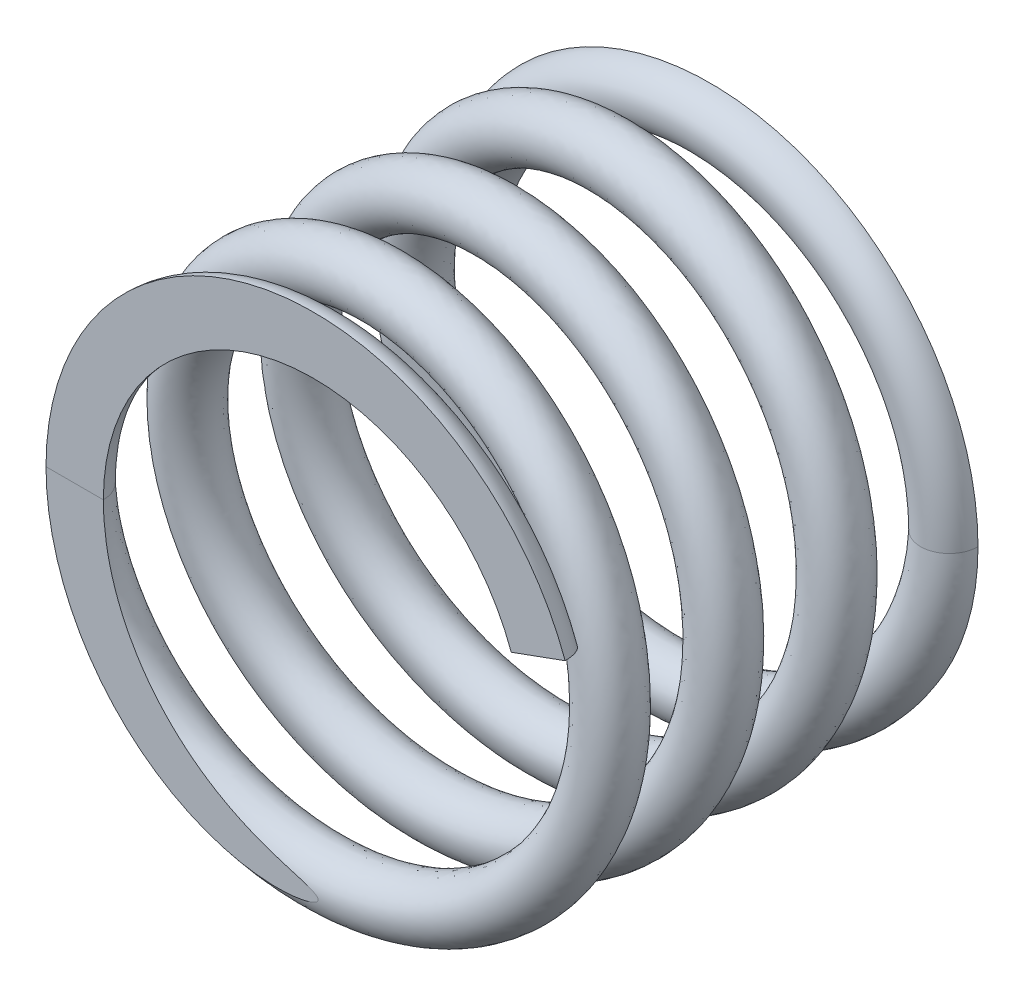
ISO-10303-21;
HEADER;
FILE_DESCRIPTION(('STEP AP214'),'2;1');
FILE_NAME('part.step','',(''),(''),'','','');
FILE_SCHEMA(('AUTOMOTIVE_DESIGN { 1 0 10303 214 1 1 1 1 }'));
ENDSEC;
DATA;
#1=APPLICATION_CONTEXT('core data for automotive mechanical design processes');
#2=APPLICATION_PROTOCOL_DEFINITION('international standard','automotive_design',2000,#1);
#3=PRODUCT_CONTEXT('',#1,'mechanical');
#4=PRODUCT('Part','Part','',(#3));
#5=PRODUCT_RELATED_PRODUCT_CATEGORY('part','',(#4));
#6=PRODUCT_DEFINITION_FORMATION('','',#4);
#7=PRODUCT_DEFINITION_CONTEXT('part definition',#1,'design');
#8=PRODUCT_DEFINITION('design','',#6,#7);
#9=PRODUCT_DEFINITION_SHAPE('','',#8);
#10=(LENGTH_UNIT() NAMED_UNIT(*) SI_UNIT(.MILLI.,.METRE.));
#11=(NAMED_UNIT(*) PLANE_ANGLE_UNIT() SI_UNIT($,.RADIAN.));
#12=(NAMED_UNIT(*) SI_UNIT($,.STERADIAN.) SOLID_ANGLE_UNIT());
#13=UNCERTAINTY_MEASURE_WITH_UNIT(LENGTH_MEASURE(1.E-05),#10,'distance_accuracy_value','');
#14=(GEOMETRIC_REPRESENTATION_CONTEXT(3) GLOBAL_UNCERTAINTY_ASSIGNED_CONTEXT((#13)) GLOBAL_UNIT_ASSIGNED_CONTEXT((#10,
#11,#12)) REPRESENTATION_CONTEXT('',''));
#15=CARTESIAN_POINT('',(0.,0.,0.));
#16=DIRECTION('',(0.,0.,1.));
#17=DIRECTION('',(1.,0.,0.));
#18=AXIS2_PLACEMENT_3D('',#15,#16,#17);
#19=CARTESIAN_POINT('',(5.,0.,0.6));
#20=CARTESIAN_POINT('',(5.,-1.62459848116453,0.718571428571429));
#21=CARTESIAN_POINT('',(4.04508497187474,-2.93892626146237,0.837142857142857));
#22=CARTESIAN_POINT('',(3.09016994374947,-4.2532540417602,0.955714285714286));
#23=CARTESIAN_POINT('',(1.54508497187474,-4.75528258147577,1.07428571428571));
#24=CARTESIAN_POINT('',(0.,-5.25731112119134,1.19285714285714));
#25=CARTESIAN_POINT('',(-1.54508497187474,-4.75528258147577,1.31142857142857));
#26=CARTESIAN_POINT('',(-3.09016994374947,-4.2532540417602,1.43));
#27=CARTESIAN_POINT('',(-4.04508497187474,-2.93892626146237,1.54857142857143));
#28=CARTESIAN_POINT('',(-5.,-1.62459848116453,1.66714285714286));
#29=CARTESIAN_POINT('',(-5.,0.,1.78571428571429));
#30=CARTESIAN_POINT('',(-5.,1.62459848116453,1.90428571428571));
#31=CARTESIAN_POINT('',(-4.04508497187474,2.93892626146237,2.02285714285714));
#32=CARTESIAN_POINT('',(-3.09016994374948,4.2532540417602,2.14142857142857));
#33=CARTESIAN_POINT('',(-1.54508497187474,4.75528258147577,2.26));
#34=CARTESIAN_POINT('',(0.,5.25731112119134,2.37857142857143));
#35=CARTESIAN_POINT('',(1.54508497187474,4.75528258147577,2.49714285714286));
#36=CARTESIAN_POINT('',(3.09016994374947,4.2532540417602,2.61571428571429));
#37=CARTESIAN_POINT('',(4.04508497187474,2.93892626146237,2.73428571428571));
#38=CARTESIAN_POINT('',(5.,1.62459848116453,2.85285714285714));
#39=CARTESIAN_POINT('',(5.,0.,2.97142857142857));
#40=CARTESIAN_POINT('',(5.,-1.62459848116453,3.09));
#41=CARTESIAN_POINT('',(4.04508497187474,-2.93892626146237,3.20857142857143));
#42=CARTESIAN_POINT('',(3.09016994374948,-4.2532540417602,3.32714285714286));
#43=CARTESIAN_POINT('',(1.54508497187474,-4.75528258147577,3.44571428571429));
#44=CARTESIAN_POINT('',(0.,-5.25731112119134,3.56428571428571));
#45=CARTESIAN_POINT('',(-1.54508497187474,-4.75528258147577,3.68285714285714));
#46=CARTESIAN_POINT('',(-3.09016994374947,-4.2532540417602,3.80142857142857));
#47=CARTESIAN_POINT('',(-4.04508497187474,-2.93892626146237,3.92));
#48=CARTESIAN_POINT('',(-5.,-1.62459848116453,4.03857142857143));
#49=CARTESIAN_POINT('',(-5.,0.,4.15714285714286));
#50=CARTESIAN_POINT('',(-5.,1.62459848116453,4.27571428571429));
#51=CARTESIAN_POINT('',(-4.04508497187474,2.93892626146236,4.39428571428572));
#52=CARTESIAN_POINT('',(-3.09016994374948,4.2532540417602,4.51285714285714));
#53=CARTESIAN_POINT('',(-1.54508497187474,4.75528258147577,4.63142857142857));
#54=CARTESIAN_POINT('',(0.,5.25731112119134,4.75));
#55=CARTESIAN_POINT('',(1.54508497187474,4.75528258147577,4.86857142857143));
#56=CARTESIAN_POINT('',(3.09016994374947,4.2532540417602,4.98714285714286));
#57=CARTESIAN_POINT('',(4.04508497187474,2.93892626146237,5.10571428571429));
#58=CARTESIAN_POINT('',(5.,1.62459848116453,5.22428571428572));
#59=CARTESIAN_POINT('',(5.,0.,5.34285714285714));
#60=CARTESIAN_POINT('',(5.,-1.62459848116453,5.46142857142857));
#61=CARTESIAN_POINT('',(4.04508497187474,-2.93892626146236,5.58));
#62=CARTESIAN_POINT('',(3.09016994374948,-4.2532540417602,5.69857142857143));
#63=CARTESIAN_POINT('',(1.54508497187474,-4.75528258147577,5.81714285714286));
#64=CARTESIAN_POINT('',(0.,-5.25731112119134,5.93571428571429));
#65=CARTESIAN_POINT('',(-1.54508497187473,-4.75528258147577,6.05428571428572));
#66=CARTESIAN_POINT('',(-3.09016994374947,-4.2532540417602,6.17285714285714));
#67=CARTESIAN_POINT('',(-4.04508497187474,-2.93892626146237,6.29142857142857));
#68=CARTESIAN_POINT('',(-5.,-1.62459848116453,6.41));
#69=CARTESIAN_POINT('',(-5.,0.,6.52857142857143));
#70=CARTESIAN_POINT('',(-5.,1.62459848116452,6.64714285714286));
#71=CARTESIAN_POINT('',(-4.04508497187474,2.93892626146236,6.76571428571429));
#72=CARTESIAN_POINT('',(-3.09016994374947,4.2532540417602,6.88428571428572));
#73=CARTESIAN_POINT('',(-1.54508497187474,4.75528258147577,7.00285714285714));
#74=CARTESIAN_POINT('',(0.,5.25731112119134,7.12142857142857));
#75=CARTESIAN_POINT('',(1.54508497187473,4.75528258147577,7.24));
#76=CARTESIAN_POINT('',(3.09016994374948,4.2532540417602,7.35857142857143));
#77=CARTESIAN_POINT('',(4.04508497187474,2.93892626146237,7.47714285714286));
#78=CARTESIAN_POINT('',(5.,1.62459848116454,7.59571428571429));
#79=CARTESIAN_POINT('',(5.,0.,7.71428571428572));
#80=CARTESIAN_POINT('',(5.,-1.62459848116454,7.83285714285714));
#81=CARTESIAN_POINT('',(4.04508497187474,-2.93892626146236,7.95142857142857));
#82=CARTESIAN_POINT('',(3.09016994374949,-4.25325404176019,8.07));
#83=CARTESIAN_POINT('',(1.54508497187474,-4.75528258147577,8.18857142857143));
#84=CARTESIAN_POINT('',(0.,-5.25731112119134,8.30714285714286));
#85=CARTESIAN_POINT('',(-1.54508497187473,-4.75528258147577,8.42571428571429));
#86=CARTESIAN_POINT('',(-3.09016994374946,-4.25325404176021,8.54428571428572));
#87=CARTESIAN_POINT('',(-4.04508497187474,-2.93892626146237,8.66285714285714));
#88=CARTESIAN_POINT('',(-5.,-1.62459848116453,8.78142857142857));
#89=CARTESIAN_POINT('',(-5.,0.,8.9));
#90=CARTESIAN_POINT('',(5.15694991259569,0.,0.6));
#91=CARTESIAN_POINT('',(5.15694991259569,-1.67559459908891,0.718571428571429));
#92=CARTESIAN_POINT('',(4.17206011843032,-3.03117910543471,0.837142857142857));
#93=CARTESIAN_POINT('',(3.18717032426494,-4.38676361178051,0.955714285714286));
#94=CARTESIAN_POINT('',(1.59358516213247,-4.90455081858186,1.07428571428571));
#95=CARTESIAN_POINT('',(0.,-5.42233802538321,1.19285714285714));
#96=CARTESIAN_POINT('',(-1.59358516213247,-4.90455081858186,1.31142857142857));
#97=CARTESIAN_POINT('',(-3.18717032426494,-4.38676361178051,1.43));
#98=CARTESIAN_POINT('',(-4.17206011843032,-3.03117910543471,1.54857142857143));
#99=CARTESIAN_POINT('',(-5.15694991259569,-1.67559459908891,1.66714285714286));
#100=CARTESIAN_POINT('',(-5.15694991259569,0.,1.78571428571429));
#101=CARTESIAN_POINT('',(-5.15694991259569,1.67559459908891,1.90428571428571));
#102=CARTESIAN_POINT('',(-4.17206011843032,3.03117910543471,2.02285714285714));
#103=CARTESIAN_POINT('',(-3.18717032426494,4.38676361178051,2.14142857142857));
#104=CARTESIAN_POINT('',(-1.59358516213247,4.90455081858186,2.26));
#105=CARTESIAN_POINT('',(0.,5.42233802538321,2.37857142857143));
#106=CARTESIAN_POINT('',(1.59358516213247,4.90455081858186,2.49714285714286));
#107=CARTESIAN_POINT('',(3.18717032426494,4.38676361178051,2.61571428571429));
#108=CARTESIAN_POINT('',(4.17206011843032,3.03117910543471,2.73428571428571));
#109=CARTESIAN_POINT('',(5.15694991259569,1.67559459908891,2.85285714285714));
#110=CARTESIAN_POINT('',(5.15694991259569,0.,2.97142857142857));
#111=CARTESIAN_POINT('',(5.15694991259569,-1.6755945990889,3.09));
#112=CARTESIAN_POINT('',(4.17206011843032,-3.03117910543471,3.20857142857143));
#113=CARTESIAN_POINT('',(3.18717032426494,-4.38676361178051,3.32714285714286));
#114=CARTESIAN_POINT('',(1.59358516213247,-4.90455081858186,3.44571428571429));
#115=CARTESIAN_POINT('',(0.,-5.42233802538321,3.56428571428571));
#116=CARTESIAN_POINT('',(-1.59358516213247,-4.90455081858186,3.68285714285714));
#117=CARTESIAN_POINT('',(-3.18717032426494,-4.38676361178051,3.80142857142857));
#118=CARTESIAN_POINT('',(-4.17206011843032,-3.03117910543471,3.92));
#119=CARTESIAN_POINT('',(-5.15694991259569,-1.67559459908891,4.03857142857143));
#120=CARTESIAN_POINT('',(-5.15694991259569,0.,4.15714285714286));
#121=CARTESIAN_POINT('',(-5.15694991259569,1.6755945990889,4.27571428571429));
#122=CARTESIAN_POINT('',(-4.17206011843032,3.03117910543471,4.39428571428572));
#123=CARTESIAN_POINT('',(-3.18717032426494,4.38676361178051,4.51285714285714));
#124=CARTESIAN_POINT('',(-1.59358516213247,4.90455081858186,4.63142857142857));
#125=CARTESIAN_POINT('',(0.,5.42233802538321,4.75));
#126=CARTESIAN_POINT('',(1.59358516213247,4.90455081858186,4.86857142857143));
#127=CARTESIAN_POINT('',(3.18717032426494,4.38676361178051,4.98714285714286));
#128=CARTESIAN_POINT('',(4.17206011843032,3.03117910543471,5.10571428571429));
#129=CARTESIAN_POINT('',(5.15694991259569,1.67559459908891,5.22428571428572));
#130=CARTESIAN_POINT('',(5.15694991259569,0.,5.34285714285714));
#131=CARTESIAN_POINT('',(5.15694991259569,-1.6755945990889,5.46142857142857));
#132=CARTESIAN_POINT('',(4.17206011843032,-3.03117910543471,5.58));
#133=CARTESIAN_POINT('',(3.18717032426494,-4.38676361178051,5.69857142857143));
#134=CARTESIAN_POINT('',(1.59358516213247,-4.90455081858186,5.81714285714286));
#135=CARTESIAN_POINT('',(0.,-5.42233802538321,5.93571428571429));
#136=CARTESIAN_POINT('',(-1.59358516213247,-4.90455081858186,6.05428571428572));
#137=CARTESIAN_POINT('',(-3.18717032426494,-4.38676361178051,6.17285714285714));
#138=CARTESIAN_POINT('',(-4.17206011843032,-3.03117910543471,6.29142857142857));
#139=CARTESIAN_POINT('',(-5.15694991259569,-1.67559459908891,6.41));
#140=CARTESIAN_POINT('',(-5.15694991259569,0.,6.52857142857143));
#141=CARTESIAN_POINT('',(-5.1569499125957,1.67559459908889,6.64714285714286));
#142=CARTESIAN_POINT('',(-4.17206011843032,3.0311791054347,6.76571428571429));
#143=CARTESIAN_POINT('',(-3.18717032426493,4.38676361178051,6.88428571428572));
#144=CARTESIAN_POINT('',(-1.59358516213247,4.90455081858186,7.00285714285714));
#145=CARTESIAN_POINT('',(0.,5.42233802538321,7.12142857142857));
#146=CARTESIAN_POINT('',(1.59358516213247,4.90455081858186,7.24));
#147=CARTESIAN_POINT('',(3.18717032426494,4.38676361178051,7.35857142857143));
#148=CARTESIAN_POINT('',(4.17206011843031,3.03117910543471,7.47714285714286));
#149=CARTESIAN_POINT('',(5.15694991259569,1.67559459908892,7.59571428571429));
#150=CARTESIAN_POINT('',(5.15694991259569,0.,7.71428571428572));
#151=CARTESIAN_POINT('',(5.15694991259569,-1.67559459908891,7.83285714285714));
#152=CARTESIAN_POINT('',(4.17206011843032,-3.0311791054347,7.95142857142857));
#153=CARTESIAN_POINT('',(3.18717032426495,-4.3867636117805,8.07));
#154=CARTESIAN_POINT('',(1.59358516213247,-4.90455081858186,8.18857142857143));
#155=CARTESIAN_POINT('',(0.,-5.42233802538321,8.30714285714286));
#156=CARTESIAN_POINT('',(-1.59358516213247,-4.90455081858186,8.42571428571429));
#157=CARTESIAN_POINT('',(-3.18717032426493,-4.38676361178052,8.54428571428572));
#158=CARTESIAN_POINT('',(-4.17206011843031,-3.03117910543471,8.66285714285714));
#159=CARTESIAN_POINT('',(-5.1569499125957,-1.6755945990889,8.78142857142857));
#160=CARTESIAN_POINT('',(-5.15694991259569,0.,8.9));
#161=CARTESIAN_POINT('',(5.6,0.,0.509716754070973));
#162=CARTESIAN_POINT('',(5.6,-1.81955029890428,0.628288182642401));
#163=CARTESIAN_POINT('',(4.53049516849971,-3.29159741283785,0.74685961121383));
#164=CARTESIAN_POINT('',(3.46099033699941,-4.76364452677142,0.865431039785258));
#165=CARTESIAN_POINT('',(1.73049516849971,-5.32591649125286,0.984002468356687));
#166=CARTESIAN_POINT('',(0.,-5.8881884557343,1.10257389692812));
#167=CARTESIAN_POINT('',(-1.7304951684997,-5.32591649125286,1.22114532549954));
#168=CARTESIAN_POINT('',(-3.46099033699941,-4.76364452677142,1.33971675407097));
#169=CARTESIAN_POINT('',(-4.53049516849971,-3.29159741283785,1.4582881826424));
#170=CARTESIAN_POINT('',(-5.6,-1.81955029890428,1.57685961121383));
#171=CARTESIAN_POINT('',(-5.6,0.,1.69543103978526));
#172=CARTESIAN_POINT('',(-5.6,1.81955029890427,1.81400246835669));
#173=CARTESIAN_POINT('',(-4.53049516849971,3.29159741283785,1.93257389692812));
#174=CARTESIAN_POINT('',(-3.46099033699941,4.76364452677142,2.05114532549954));
#175=CARTESIAN_POINT('',(-1.73049516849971,5.32591649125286,2.16971675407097));
#176=CARTESIAN_POINT('',(0.,5.8881884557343,2.2882881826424));
#177=CARTESIAN_POINT('',(1.7304951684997,5.32591649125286,2.40685961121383));
#178=CARTESIAN_POINT('',(3.46099033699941,4.76364452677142,2.52543103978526));
#179=CARTESIAN_POINT('',(4.53049516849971,3.29159741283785,2.64400246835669));
#180=CARTESIAN_POINT('',(5.6,1.81955029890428,2.76257389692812));
#181=CARTESIAN_POINT('',(5.6,0.,2.88114532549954));
#182=CARTESIAN_POINT('',(5.6,-1.81955029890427,2.99971675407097));
#183=CARTESIAN_POINT('',(4.53049516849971,-3.29159741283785,3.1182881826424));
#184=CARTESIAN_POINT('',(3.46099033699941,-4.76364452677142,3.23685961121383));
#185=CARTESIAN_POINT('',(1.73049516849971,-5.32591649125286,3.35543103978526));
#186=CARTESIAN_POINT('',(0.,-5.8881884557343,3.47400246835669));
#187=CARTESIAN_POINT('',(-1.7304951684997,-5.32591649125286,3.59257389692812));
#188=CARTESIAN_POINT('',(-3.46099033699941,-4.76364452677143,3.71114532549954));
#189=CARTESIAN_POINT('',(-4.53049516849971,-3.29159741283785,3.82971675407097));
#190=CARTESIAN_POINT('',(-5.6,-1.81955029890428,3.9482881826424));
#191=CARTESIAN_POINT('',(-5.6,0.,4.06685961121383));
#192=CARTESIAN_POINT('',(-5.6,1.81955029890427,4.18543103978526));
#193=CARTESIAN_POINT('',(-4.53049516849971,3.29159741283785,4.30400246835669));
#194=CARTESIAN_POINT('',(-3.46099033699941,4.76364452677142,4.42257389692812));
#195=CARTESIAN_POINT('',(-1.73049516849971,5.32591649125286,4.54114532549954));
#196=CARTESIAN_POINT('',(0.,5.8881884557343,4.65971675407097));
#197=CARTESIAN_POINT('',(1.7304951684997,5.32591649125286,4.7782881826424));
#198=CARTESIAN_POINT('',(3.46099033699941,4.76364452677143,4.89685961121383));
#199=CARTESIAN_POINT('',(4.5304951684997,3.29159741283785,5.01543103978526));
#200=CARTESIAN_POINT('',(5.6,1.81955029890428,5.13400246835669));
#201=CARTESIAN_POINT('',(5.6,0.,5.25257389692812));
#202=CARTESIAN_POINT('',(5.6,-1.81955029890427,5.37114532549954));
#203=CARTESIAN_POINT('',(4.53049516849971,-3.29159741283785,5.48971675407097));
#204=CARTESIAN_POINT('',(3.46099033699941,-4.76364452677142,5.6082881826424));
#205=CARTESIAN_POINT('',(1.73049516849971,-5.32591649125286,5.72685961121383));
#206=CARTESIAN_POINT('',(0.,-5.8881884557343,5.84543103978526));
#207=CARTESIAN_POINT('',(-1.7304951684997,-5.32591649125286,5.96400246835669));
#208=CARTESIAN_POINT('',(-3.46099033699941,-4.76364452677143,6.08257389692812));
#209=CARTESIAN_POINT('',(-4.5304951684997,-3.29159741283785,6.20114532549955));
#210=CARTESIAN_POINT('',(-5.6,-1.81955029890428,6.31971675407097));
#211=CARTESIAN_POINT('',(-5.6,0.,6.4382881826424));
#212=CARTESIAN_POINT('',(-5.6,1.81955029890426,6.55685961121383));
#213=CARTESIAN_POINT('',(-4.53049516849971,3.29159741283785,6.67543103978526));
#214=CARTESIAN_POINT('',(-3.46099033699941,4.76364452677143,6.79400246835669));
#215=CARTESIAN_POINT('',(-1.73049516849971,5.32591649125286,6.91257389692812));
#216=CARTESIAN_POINT('',(0.,5.8881884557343,7.03114532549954));
#217=CARTESIAN_POINT('',(1.7304951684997,5.32591649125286,7.14971675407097));
#218=CARTESIAN_POINT('',(3.46099033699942,4.76364452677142,7.2682881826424));
#219=CARTESIAN_POINT('',(4.5304951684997,3.29159741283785,7.38685961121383));
#220=CARTESIAN_POINT('',(5.6,1.81955029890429,7.50543103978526));
#221=CARTESIAN_POINT('',(5.6,0.,7.62400246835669));
#222=CARTESIAN_POINT('',(5.6,-1.81955029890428,7.74257389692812));
#223=CARTESIAN_POINT('',(4.53049516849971,-3.29159741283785,7.86114532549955));
#224=CARTESIAN_POINT('',(3.46099033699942,-4.76364452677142,7.97971675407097));
#225=CARTESIAN_POINT('',(1.73049516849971,-5.32591649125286,8.0982881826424));
#226=CARTESIAN_POINT('',(0.,-5.8881884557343,8.21685961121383));
#227=CARTESIAN_POINT('',(-1.7304951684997,-5.32591649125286,8.33543103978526));
#228=CARTESIAN_POINT('',(-3.4609903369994,-4.76364452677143,8.45400246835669));
#229=CARTESIAN_POINT('',(-4.5304951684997,-3.29159741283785,8.57257389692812));
#230=CARTESIAN_POINT('',(-5.6,-1.81955029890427,8.69114532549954));
#231=CARTESIAN_POINT('',(-5.6,0.,8.80971675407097));
#232=CARTESIAN_POINT('',(5.6,0.,-0.509716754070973));
#233=CARTESIAN_POINT('',(5.6,-1.81955029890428,-0.391145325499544));
#234=CARTESIAN_POINT('',(4.53049516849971,-3.29159741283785,-0.272573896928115));
#235=CARTESIAN_POINT('',(3.46099033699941,-4.76364452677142,-0.154002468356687));
#236=CARTESIAN_POINT('',(1.73049516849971,-5.32591649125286,-0.0354310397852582));
#237=CARTESIAN_POINT('',(0.,-5.8881884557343,0.0831403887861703));
#238=CARTESIAN_POINT('',(-1.7304951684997,-5.32591649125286,0.201711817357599));
#239=CARTESIAN_POINT('',(-3.46099033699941,-4.76364452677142,0.320283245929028));
#240=CARTESIAN_POINT('',(-4.53049516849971,-3.29159741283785,0.438854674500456));
#241=CARTESIAN_POINT('',(-5.6,-1.81955029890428,0.557426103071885));
#242=CARTESIAN_POINT('',(-5.6,0.,0.675997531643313));
#243=CARTESIAN_POINT('',(-5.6,1.81955029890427,0.794568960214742));
#244=CARTESIAN_POINT('',(-4.53049516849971,3.29159741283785,0.91314038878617));
#245=CARTESIAN_POINT('',(-3.46099033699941,4.76364452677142,1.0317118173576));
#246=CARTESIAN_POINT('',(-1.73049516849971,5.32591649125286,1.15028324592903));
#247=CARTESIAN_POINT('',(0.,5.8881884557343,1.26885467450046));
#248=CARTESIAN_POINT('',(1.7304951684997,5.32591649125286,1.38742610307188));
#249=CARTESIAN_POINT('',(3.46099033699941,4.76364452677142,1.50599753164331));
#250=CARTESIAN_POINT('',(4.53049516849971,3.29159741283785,1.62456896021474));
#251=CARTESIAN_POINT('',(5.6,1.81955029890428,1.74314038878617));
#252=CARTESIAN_POINT('',(5.6,0.,1.8617118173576));
#253=CARTESIAN_POINT('',(5.6,-1.81955029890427,1.98028324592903));
#254=CARTESIAN_POINT('',(4.53049516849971,-3.29159741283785,2.09885467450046));
#255=CARTESIAN_POINT('',(3.46099033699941,-4.76364452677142,2.21742610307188));
#256=CARTESIAN_POINT('',(1.73049516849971,-5.32591649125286,2.33599753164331));
#257=CARTESIAN_POINT('',(0.,-5.8881884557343,2.45456896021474));
#258=CARTESIAN_POINT('',(-1.7304951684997,-5.32591649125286,2.57314038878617));
#259=CARTESIAN_POINT('',(-3.46099033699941,-4.76364452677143,2.6917118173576));
#260=CARTESIAN_POINT('',(-4.53049516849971,-3.29159741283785,2.81028324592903));
#261=CARTESIAN_POINT('',(-5.6,-1.81955029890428,2.92885467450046));
#262=CARTESIAN_POINT('',(-5.6,0.,3.04742610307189));
#263=CARTESIAN_POINT('',(-5.6,1.81955029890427,3.16599753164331));
#264=CARTESIAN_POINT('',(-4.53049516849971,3.29159741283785,3.28456896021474));
#265=CARTESIAN_POINT('',(-3.46099033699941,4.76364452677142,3.40314038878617));
#266=CARTESIAN_POINT('',(-1.73049516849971,5.32591649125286,3.5217118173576));
#267=CARTESIAN_POINT('',(0.,5.8881884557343,3.64028324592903));
#268=CARTESIAN_POINT('',(1.7304951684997,5.32591649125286,3.75885467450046));
#269=CARTESIAN_POINT('',(3.46099033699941,4.76364452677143,3.87742610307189));
#270=CARTESIAN_POINT('',(4.5304951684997,3.29159741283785,3.99599753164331));
#271=CARTESIAN_POINT('',(5.6,1.81955029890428,4.11456896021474));
#272=CARTESIAN_POINT('',(5.6,0.,4.23314038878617));
#273=CARTESIAN_POINT('',(5.6,-1.81955029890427,4.3517118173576));
#274=CARTESIAN_POINT('',(4.53049516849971,-3.29159741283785,4.47028324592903));
#275=CARTESIAN_POINT('',(3.46099033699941,-4.76364452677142,4.58885467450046));
#276=CARTESIAN_POINT('',(1.73049516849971,-5.32591649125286,4.70742610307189));
#277=CARTESIAN_POINT('',(0.,-5.8881884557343,4.82599753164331));
#278=CARTESIAN_POINT('',(-1.7304951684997,-5.32591649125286,4.94456896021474));
#279=CARTESIAN_POINT('',(-3.46099033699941,-4.76364452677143,5.06314038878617));
#280=CARTESIAN_POINT('',(-4.5304951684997,-3.29159741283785,5.1817118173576));
#281=CARTESIAN_POINT('',(-5.6,-1.81955029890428,5.30028324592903));
#282=CARTESIAN_POINT('',(-5.6,0.,5.41885467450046));
#283=CARTESIAN_POINT('',(-5.6,1.81955029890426,5.53742610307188));
#284=CARTESIAN_POINT('',(-4.53049516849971,3.29159741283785,5.65599753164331));
#285=CARTESIAN_POINT('',(-3.46099033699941,4.76364452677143,5.77456896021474));
#286=CARTESIAN_POINT('',(-1.73049516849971,5.32591649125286,5.89314038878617));
#287=CARTESIAN_POINT('',(0.,5.8881884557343,6.0117118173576));
#288=CARTESIAN_POINT('',(1.7304951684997,5.32591649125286,6.13028324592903));
#289=CARTESIAN_POINT('',(3.46099033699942,4.76364452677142,6.24885467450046));
#290=CARTESIAN_POINT('',(4.5304951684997,3.29159741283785,6.36742610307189));
#291=CARTESIAN_POINT('',(5.6,1.81955029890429,6.48599753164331));
#292=CARTESIAN_POINT('',(5.6,0.,6.60456896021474));
#293=CARTESIAN_POINT('',(5.6,-1.81955029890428,6.72314038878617));
#294=CARTESIAN_POINT('',(4.53049516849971,-3.29159741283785,6.8417118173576));
#295=CARTESIAN_POINT('',(3.46099033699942,-4.76364452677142,6.96028324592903));
#296=CARTESIAN_POINT('',(1.73049516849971,-5.32591649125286,7.07885467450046));
#297=CARTESIAN_POINT('',(0.,-5.8881884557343,7.19742610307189));
#298=CARTESIAN_POINT('',(-1.7304951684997,-5.32591649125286,7.31599753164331));
#299=CARTESIAN_POINT('',(-3.4609903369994,-4.76364452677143,7.43456896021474));
#300=CARTESIAN_POINT('',(-4.5304951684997,-3.29159741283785,7.55314038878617));
#301=CARTESIAN_POINT('',(-5.6,-1.81955029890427,7.6717118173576));
#302=CARTESIAN_POINT('',(-5.6,0.,7.79028324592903));
#303=CARTESIAN_POINT('',(5.15694991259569,0.,-0.6));
#304=CARTESIAN_POINT('',(5.15694991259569,-1.67559459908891,-0.481428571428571));
#305=CARTESIAN_POINT('',(4.17206011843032,-3.03117910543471,-0.362857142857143));
#306=CARTESIAN_POINT('',(3.18717032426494,-4.38676361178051,-0.244285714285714));
#307=CARTESIAN_POINT('',(1.59358516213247,-4.90455081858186,-0.125714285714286));
#308=CARTESIAN_POINT('',(0.,-5.42233802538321,-0.00714285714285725));
#309=CARTESIAN_POINT('',(-1.59358516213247,-4.90455081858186,0.111428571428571));
#310=CARTESIAN_POINT('',(-3.18717032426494,-4.38676361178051,0.23));
#311=CARTESIAN_POINT('',(-4.17206011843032,-3.03117910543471,0.348571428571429));
#312=CARTESIAN_POINT('',(-5.15694991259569,-1.67559459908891,0.467142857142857));
#313=CARTESIAN_POINT('',(-5.15694991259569,0.,0.585714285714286));
#314=CARTESIAN_POINT('',(-5.15694991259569,1.67559459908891,0.704285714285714));
#315=CARTESIAN_POINT('',(-4.17206011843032,3.03117910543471,0.822857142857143));
#316=CARTESIAN_POINT('',(-3.18717032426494,4.38676361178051,0.941428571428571));
#317=CARTESIAN_POINT('',(-1.59358516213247,4.90455081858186,1.06));
#318=CARTESIAN_POINT('',(0.,5.42233802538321,1.17857142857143));
#319=CARTESIAN_POINT('',(1.59358516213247,4.90455081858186,1.29714285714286));
#320=CARTESIAN_POINT('',(3.18717032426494,4.38676361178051,1.41571428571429));
#321=CARTESIAN_POINT('',(4.17206011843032,3.03117910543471,1.53428571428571));
#322=CARTESIAN_POINT('',(5.15694991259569,1.67559459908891,1.65285714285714));
#323=CARTESIAN_POINT('',(5.15694991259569,0.,1.77142857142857));
#324=CARTESIAN_POINT('',(5.15694991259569,-1.6755945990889,1.89));
#325=CARTESIAN_POINT('',(4.17206011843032,-3.03117910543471,2.00857142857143));
#326=CARTESIAN_POINT('',(3.18717032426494,-4.38676361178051,2.12714285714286));
#327=CARTESIAN_POINT('',(1.59358516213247,-4.90455081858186,2.24571428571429));
#328=CARTESIAN_POINT('',(0.,-5.42233802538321,2.36428571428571));
#329=CARTESIAN_POINT('',(-1.59358516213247,-4.90455081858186,2.48285714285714));
#330=CARTESIAN_POINT('',(-3.18717032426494,-4.38676361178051,2.60142857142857));
#331=CARTESIAN_POINT('',(-4.17206011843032,-3.03117910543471,2.72));
#332=CARTESIAN_POINT('',(-5.15694991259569,-1.67559459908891,2.83857142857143));
#333=CARTESIAN_POINT('',(-5.15694991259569,0.,2.95714285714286));
#334=CARTESIAN_POINT('',(-5.15694991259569,1.6755945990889,3.07571428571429));
#335=CARTESIAN_POINT('',(-4.17206011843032,3.03117910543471,3.19428571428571));
#336=CARTESIAN_POINT('',(-3.18717032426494,4.38676361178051,3.31285714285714));
#337=CARTESIAN_POINT('',(-1.59358516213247,4.90455081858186,3.43142857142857));
#338=CARTESIAN_POINT('',(0.,5.42233802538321,3.55));
#339=CARTESIAN_POINT('',(1.59358516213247,4.90455081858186,3.66857142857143));
#340=CARTESIAN_POINT('',(3.18717032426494,4.38676361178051,3.78714285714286));
#341=CARTESIAN_POINT('',(4.17206011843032,3.03117910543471,3.90571428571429));
#342=CARTESIAN_POINT('',(5.15694991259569,1.67559459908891,4.02428571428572));
#343=CARTESIAN_POINT('',(5.15694991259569,0.,4.14285714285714));
#344=CARTESIAN_POINT('',(5.15694991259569,-1.6755945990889,4.26142857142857));
#345=CARTESIAN_POINT('',(4.17206011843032,-3.03117910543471,4.38));
#346=CARTESIAN_POINT('',(3.18717032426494,-4.38676361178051,4.49857142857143));
#347=CARTESIAN_POINT('',(1.59358516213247,-4.90455081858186,4.61714285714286));
#348=CARTESIAN_POINT('',(0.,-5.42233802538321,4.73571428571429));
#349=CARTESIAN_POINT('',(-1.59358516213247,-4.90455081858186,4.85428571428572));
#350=CARTESIAN_POINT('',(-3.18717032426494,-4.38676361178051,4.97285714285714));
#351=CARTESIAN_POINT('',(-4.17206011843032,-3.03117910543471,5.09142857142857));
#352=CARTESIAN_POINT('',(-5.15694991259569,-1.67559459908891,5.21));
#353=CARTESIAN_POINT('',(-5.15694991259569,0.,5.32857142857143));
#354=CARTESIAN_POINT('',(-5.1569499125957,1.67559459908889,5.44714285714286));
#355=CARTESIAN_POINT('',(-4.17206011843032,3.0311791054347,5.56571428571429));
#356=CARTESIAN_POINT('',(-3.18717032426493,4.38676361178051,5.68428571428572));
#357=CARTESIAN_POINT('',(-1.59358516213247,4.90455081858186,5.80285714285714));
#358=CARTESIAN_POINT('',(0.,5.42233802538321,5.92142857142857));
#359=CARTESIAN_POINT('',(1.59358516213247,4.90455081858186,6.04));
#360=CARTESIAN_POINT('',(3.18717032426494,4.38676361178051,6.15857142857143));
#361=CARTESIAN_POINT('',(4.17206011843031,3.03117910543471,6.27714285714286));
#362=CARTESIAN_POINT('',(5.15694991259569,1.67559459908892,6.39571428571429));
#363=CARTESIAN_POINT('',(5.15694991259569,0.,6.51428571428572));
#364=CARTESIAN_POINT('',(5.15694991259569,-1.67559459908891,6.63285714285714));
#365=CARTESIAN_POINT('',(4.17206011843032,-3.0311791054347,6.75142857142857));
#366=CARTESIAN_POINT('',(3.18717032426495,-4.3867636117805,6.87));
#367=CARTESIAN_POINT('',(1.59358516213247,-4.90455081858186,6.98857142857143));
#368=CARTESIAN_POINT('',(0.,-5.42233802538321,7.10714285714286));
#369=CARTESIAN_POINT('',(-1.59358516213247,-4.90455081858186,7.22571428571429));
#370=CARTESIAN_POINT('',(-3.18717032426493,-4.38676361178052,7.34428571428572));
#371=CARTESIAN_POINT('',(-4.17206011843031,-3.03117910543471,7.46285714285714));
#372=CARTESIAN_POINT('',(-5.1569499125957,-1.6755945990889,7.58142857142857));
#373=CARTESIAN_POINT('',(-5.15694991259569,0.,7.7));
#374=CARTESIAN_POINT('',(4.84305008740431,0.,-0.6));
#375=CARTESIAN_POINT('',(4.84305008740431,-1.57360236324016,-0.481428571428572));
#376=CARTESIAN_POINT('',(3.91810982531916,-2.84667341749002,-0.362857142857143));
#377=CARTESIAN_POINT('',(2.99316956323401,-4.11974447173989,-0.244285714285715));
#378=CARTESIAN_POINT('',(1.49658478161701,-4.60601434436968,-0.125714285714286));
#379=CARTESIAN_POINT('',(0.,-5.09228421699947,-0.00714285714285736));
#380=CARTESIAN_POINT('',(-1.496584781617,-4.60601434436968,0.111428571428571));
#381=CARTESIAN_POINT('',(-2.99316956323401,-4.11974447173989,0.23));
#382=CARTESIAN_POINT('',(-3.91810982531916,-2.84667341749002,0.348571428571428));
#383=CARTESIAN_POINT('',(-4.84305008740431,-1.57360236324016,0.467142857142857));
#384=CARTESIAN_POINT('',(-4.84305008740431,0.,0.585714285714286));
#385=CARTESIAN_POINT('',(-4.84305008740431,1.57360236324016,0.704285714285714));
#386=CARTESIAN_POINT('',(-3.91810982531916,2.84667341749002,0.822857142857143));
#387=CARTESIAN_POINT('',(-2.99316956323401,4.11974447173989,0.941428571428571));
#388=CARTESIAN_POINT('',(-1.49658478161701,4.60601434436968,1.06));
#389=CARTESIAN_POINT('',(0.,5.09228421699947,1.17857142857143));
#390=CARTESIAN_POINT('',(1.496584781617,4.60601434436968,1.29714285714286));
#391=CARTESIAN_POINT('',(2.99316956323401,4.11974447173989,1.41571428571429));
#392=CARTESIAN_POINT('',(3.91810982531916,2.84667341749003,1.53428571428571));
#393=CARTESIAN_POINT('',(4.84305008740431,1.57360236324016,1.65285714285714));
#394=CARTESIAN_POINT('',(4.84305008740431,0.,1.77142857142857));
#395=CARTESIAN_POINT('',(4.84305008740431,-1.57360236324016,1.89));
#396=CARTESIAN_POINT('',(3.91810982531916,-2.84667341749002,2.00857142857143));
#397=CARTESIAN_POINT('',(2.99316956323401,-4.11974447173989,2.12714285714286));
#398=CARTESIAN_POINT('',(1.49658478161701,-4.60601434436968,2.24571428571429));
#399=CARTESIAN_POINT('',(0.,-5.09228421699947,2.36428571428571));
#400=CARTESIAN_POINT('',(-1.496584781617,-4.60601434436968,2.48285714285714));
#401=CARTESIAN_POINT('',(-2.99316956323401,-4.11974447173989,2.60142857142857));
#402=CARTESIAN_POINT('',(-3.91810982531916,-2.84667341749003,2.72));
#403=CARTESIAN_POINT('',(-4.84305008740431,-1.57360236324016,2.83857142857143));
#404=CARTESIAN_POINT('',(-4.84305008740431,0.,2.95714285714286));
#405=CARTESIAN_POINT('',(-4.84305008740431,1.57360236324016,3.07571428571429));
#406=CARTESIAN_POINT('',(-3.91810982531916,2.84667341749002,3.19428571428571));
#407=CARTESIAN_POINT('',(-2.99316956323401,4.11974447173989,3.31285714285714));
#408=CARTESIAN_POINT('',(-1.49658478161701,4.60601434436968,3.43142857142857));
#409=CARTESIAN_POINT('',(0.,5.09228421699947,3.55));
#410=CARTESIAN_POINT('',(1.496584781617,4.60601434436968,3.66857142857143));
#411=CARTESIAN_POINT('',(2.99316956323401,4.11974447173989,3.78714285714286));
#412=CARTESIAN_POINT('',(3.91810982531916,2.84667341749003,3.90571428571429));
#413=CARTESIAN_POINT('',(4.84305008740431,1.57360236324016,4.02428571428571));
#414=CARTESIAN_POINT('',(4.84305008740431,0.,4.14285714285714));
#415=CARTESIAN_POINT('',(4.84305008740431,-1.57360236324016,4.26142857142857));
#416=CARTESIAN_POINT('',(3.91810982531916,-2.84667341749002,4.38));
#417=CARTESIAN_POINT('',(2.99316956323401,-4.11974447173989,4.49857142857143));
#418=CARTESIAN_POINT('',(1.49658478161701,-4.60601434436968,4.61714285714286));
#419=CARTESIAN_POINT('',(0.,-5.09228421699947,4.73571428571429));
#420=CARTESIAN_POINT('',(-1.496584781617,-4.60601434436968,4.85428571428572));
#421=CARTESIAN_POINT('',(-2.99316956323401,-4.11974447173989,4.97285714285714));
#422=CARTESIAN_POINT('',(-3.91810982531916,-2.84667341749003,5.09142857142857));
#423=CARTESIAN_POINT('',(-4.84305008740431,-1.57360236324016,5.21));
#424=CARTESIAN_POINT('',(-4.84305008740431,0.,5.32857142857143));
#425=CARTESIAN_POINT('',(-4.84305008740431,1.57360236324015,5.44714285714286));
#426=CARTESIAN_POINT('',(-3.91810982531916,2.84667341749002,5.56571428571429));
#427=CARTESIAN_POINT('',(-2.99316956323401,4.11974447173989,5.68428571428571));
#428=CARTESIAN_POINT('',(-1.49658478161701,4.60601434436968,5.80285714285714));
#429=CARTESIAN_POINT('',(0.,5.09228421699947,5.92142857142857));
#430=CARTESIAN_POINT('',(1.496584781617,4.60601434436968,6.04));
#431=CARTESIAN_POINT('',(2.99316956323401,4.11974447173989,6.15857142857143));
#432=CARTESIAN_POINT('',(3.91810982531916,2.84667341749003,6.27714285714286));
#433=CARTESIAN_POINT('',(4.8430500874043,1.57360236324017,6.39571428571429));
#434=CARTESIAN_POINT('',(4.84305008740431,0.,6.51428571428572));
#435=CARTESIAN_POINT('',(4.84305008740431,-1.57360236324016,6.63285714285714));
#436=CARTESIAN_POINT('',(3.91810982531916,-2.84667341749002,6.75142857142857));
#437=CARTESIAN_POINT('',(2.99316956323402,-4.11974447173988,6.87));
#438=CARTESIAN_POINT('',(1.49658478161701,-4.60601434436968,6.98857142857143));
#439=CARTESIAN_POINT('',(0.,-5.09228421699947,7.10714285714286));
#440=CARTESIAN_POINT('',(-1.496584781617,-4.60601434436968,7.22571428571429));
#441=CARTESIAN_POINT('',(-2.993169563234,-4.1197444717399,7.34428571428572));
#442=CARTESIAN_POINT('',(-3.91810982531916,-2.84667341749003,7.46285714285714));
#443=CARTESIAN_POINT('',(-4.84305008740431,-1.57360236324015,7.58142857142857));
#444=CARTESIAN_POINT('',(-4.84305008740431,0.,7.7));
#445=CARTESIAN_POINT('',(4.4,0.,-0.509716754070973));
#446=CARTESIAN_POINT('',(4.4,-1.42964666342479,-0.391145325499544));
#447=CARTESIAN_POINT('',(3.55967477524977,-2.58625511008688,-0.272573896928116));
#448=CARTESIAN_POINT('',(2.71934955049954,-3.74286355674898,-0.154002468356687));
#449=CARTESIAN_POINT('',(1.35967477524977,-4.18464867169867,-0.0354310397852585));
#450=CARTESIAN_POINT('',(0.,-4.62643378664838,0.08314038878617));
#451=CARTESIAN_POINT('',(-1.35967477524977,-4.18464867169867,0.201711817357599));
#452=CARTESIAN_POINT('',(-2.71934955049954,-3.74286355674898,0.320283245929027));
#453=CARTESIAN_POINT('',(-3.55967477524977,-2.58625511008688,0.438854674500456));
#454=CARTESIAN_POINT('',(-4.4,-1.42964666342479,0.557426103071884));
#455=CARTESIAN_POINT('',(-4.4,0.,0.675997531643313));
#456=CARTESIAN_POINT('',(-4.4,1.42964666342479,0.794568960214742));
#457=CARTESIAN_POINT('',(-3.55967477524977,2.58625511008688,0.91314038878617));
#458=CARTESIAN_POINT('',(-2.71934955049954,3.74286355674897,1.0317118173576));
#459=CARTESIAN_POINT('',(-1.35967477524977,4.18464867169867,1.15028324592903));
#460=CARTESIAN_POINT('',(0.,4.62643378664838,1.26885467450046));
#461=CARTESIAN_POINT('',(1.35967477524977,4.18464867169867,1.38742610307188));
#462=CARTESIAN_POINT('',(2.71934955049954,3.74286355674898,1.50599753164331));
#463=CARTESIAN_POINT('',(3.55967477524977,2.58625511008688,1.62456896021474));
#464=CARTESIAN_POINT('',(4.4,1.42964666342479,1.74314038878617));
#465=CARTESIAN_POINT('',(4.4,0.,1.8617118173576));
#466=CARTESIAN_POINT('',(4.4,-1.42964666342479,1.98028324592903));
#467=CARTESIAN_POINT('',(3.55967477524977,-2.58625511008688,2.09885467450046));
#468=CARTESIAN_POINT('',(2.71934955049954,-3.74286355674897,2.21742610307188));
#469=CARTESIAN_POINT('',(1.35967477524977,-4.18464867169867,2.33599753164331));
#470=CARTESIAN_POINT('',(0.,-4.62643378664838,2.45456896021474));
#471=CARTESIAN_POINT('',(-1.35967477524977,-4.18464867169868,2.57314038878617));
#472=CARTESIAN_POINT('',(-2.71934955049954,-3.74286355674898,2.6917118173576));
#473=CARTESIAN_POINT('',(-3.55967477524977,-2.58625511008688,2.81028324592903));
#474=CARTESIAN_POINT('',(-4.4,-1.42964666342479,2.92885467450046));
#475=CARTESIAN_POINT('',(-4.4,0.,3.04742610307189));
#476=CARTESIAN_POINT('',(-4.4,1.42964666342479,3.16599753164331));
#477=CARTESIAN_POINT('',(-3.55967477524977,2.58625511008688,3.28456896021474));
#478=CARTESIAN_POINT('',(-2.71934955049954,3.74286355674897,3.40314038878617));
#479=CARTESIAN_POINT('',(-1.35967477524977,4.18464867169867,3.5217118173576));
#480=CARTESIAN_POINT('',(0.,4.62643378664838,3.64028324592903));
#481=CARTESIAN_POINT('',(1.35967477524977,4.18464867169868,3.75885467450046));
#482=CARTESIAN_POINT('',(2.71934955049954,3.74286355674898,3.87742610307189));
#483=CARTESIAN_POINT('',(3.55967477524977,2.58625511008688,3.99599753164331));
#484=CARTESIAN_POINT('',(4.4,1.42964666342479,4.11456896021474));
#485=CARTESIAN_POINT('',(4.4,0.,4.23314038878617));
#486=CARTESIAN_POINT('',(4.4,-1.42964666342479,4.3517118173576));
#487=CARTESIAN_POINT('',(3.55967477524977,-2.58625511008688,4.47028324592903));
#488=CARTESIAN_POINT('',(2.71934955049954,-3.74286355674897,4.58885467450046));
#489=CARTESIAN_POINT('',(1.35967477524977,-4.18464867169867,4.70742610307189));
#490=CARTESIAN_POINT('',(0.,-4.62643378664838,4.82599753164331));
#491=CARTESIAN_POINT('',(-1.35967477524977,-4.18464867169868,4.94456896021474));
#492=CARTESIAN_POINT('',(-2.71934955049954,-3.74286355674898,5.06314038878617));
#493=CARTESIAN_POINT('',(-3.55967477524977,-2.58625511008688,5.1817118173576));
#494=CARTESIAN_POINT('',(-4.4,-1.42964666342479,5.30028324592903));
#495=CARTESIAN_POINT('',(-4.4,0.,5.41885467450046));
#496=CARTESIAN_POINT('',(-4.4,1.42964666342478,5.53742610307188));
#497=CARTESIAN_POINT('',(-3.55967477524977,2.58625511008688,5.65599753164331));
#498=CARTESIAN_POINT('',(-2.71934955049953,3.74286355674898,5.77456896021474));
#499=CARTESIAN_POINT('',(-1.35967477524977,4.18464867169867,5.89314038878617));
#500=CARTESIAN_POINT('',(0.,4.62643378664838,6.0117118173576));
#501=CARTESIAN_POINT('',(1.35967477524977,4.18464867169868,6.13028324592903));
#502=CARTESIAN_POINT('',(2.71934955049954,3.74286355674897,6.24885467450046));
#503=CARTESIAN_POINT('',(3.55967477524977,2.58625511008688,6.36742610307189));
#504=CARTESIAN_POINT('',(4.4,1.4296466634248,6.48599753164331));
#505=CARTESIAN_POINT('',(4.4,0.,6.60456896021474));
#506=CARTESIAN_POINT('',(4.4,-1.42964666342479,6.72314038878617));
#507=CARTESIAN_POINT('',(3.55967477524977,-2.58625511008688,6.8417118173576));
#508=CARTESIAN_POINT('',(2.71934955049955,-3.74286355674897,6.96028324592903));
#509=CARTESIAN_POINT('',(1.35967477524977,-4.18464867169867,7.07885467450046));
#510=CARTESIAN_POINT('',(0.,-4.62643378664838,7.19742610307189));
#511=CARTESIAN_POINT('',(-1.35967477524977,-4.18464867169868,7.31599753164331));
#512=CARTESIAN_POINT('',(-2.71934955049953,-3.74286355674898,7.43456896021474));
#513=CARTESIAN_POINT('',(-3.55967477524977,-2.58625511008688,7.55314038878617));
#514=CARTESIAN_POINT('',(-4.4,-1.42964666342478,7.6717118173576));
#515=CARTESIAN_POINT('',(-4.4,0.,7.79028324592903));
#516=CARTESIAN_POINT('',(4.4,0.,0.509716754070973));
#517=CARTESIAN_POINT('',(4.4,-1.42964666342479,0.628288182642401));
#518=CARTESIAN_POINT('',(3.55967477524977,-2.58625511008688,0.74685961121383));
#519=CARTESIAN_POINT('',(2.71934955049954,-3.74286355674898,0.865431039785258));
#520=CARTESIAN_POINT('',(1.35967477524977,-4.18464867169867,0.984002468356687));
#521=CARTESIAN_POINT('',(0.,-4.62643378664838,1.10257389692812));
#522=CARTESIAN_POINT('',(-1.35967477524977,-4.18464867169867,1.22114532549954));
#523=CARTESIAN_POINT('',(-2.71934955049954,-3.74286355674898,1.33971675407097));
#524=CARTESIAN_POINT('',(-3.55967477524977,-2.58625511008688,1.4582881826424));
#525=CARTESIAN_POINT('',(-4.4,-1.42964666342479,1.57685961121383));
#526=CARTESIAN_POINT('',(-4.4,0.,1.69543103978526));
#527=CARTESIAN_POINT('',(-4.4,1.42964666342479,1.81400246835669));
#528=CARTESIAN_POINT('',(-3.55967477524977,2.58625511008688,1.93257389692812));
#529=CARTESIAN_POINT('',(-2.71934955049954,3.74286355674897,2.05114532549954));
#530=CARTESIAN_POINT('',(-1.35967477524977,4.18464867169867,2.16971675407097));
#531=CARTESIAN_POINT('',(0.,4.62643378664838,2.2882881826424));
#532=CARTESIAN_POINT('',(1.35967477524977,4.18464867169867,2.40685961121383));
#533=CARTESIAN_POINT('',(2.71934955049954,3.74286355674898,2.52543103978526));
#534=CARTESIAN_POINT('',(3.55967477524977,2.58625511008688,2.64400246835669));
#535=CARTESIAN_POINT('',(4.4,1.42964666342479,2.76257389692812));
#536=CARTESIAN_POINT('',(4.4,0.,2.88114532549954));
#537=CARTESIAN_POINT('',(4.4,-1.42964666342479,2.99971675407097));
#538=CARTESIAN_POINT('',(3.55967477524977,-2.58625511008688,3.1182881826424));
#539=CARTESIAN_POINT('',(2.71934955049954,-3.74286355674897,3.23685961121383));
#540=CARTESIAN_POINT('',(1.35967477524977,-4.18464867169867,3.35543103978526));
#541=CARTESIAN_POINT('',(0.,-4.62643378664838,3.47400246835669));
#542=CARTESIAN_POINT('',(-1.35967477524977,-4.18464867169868,3.59257389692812));
#543=CARTESIAN_POINT('',(-2.71934955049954,-3.74286355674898,3.71114532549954));
#544=CARTESIAN_POINT('',(-3.55967477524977,-2.58625511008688,3.82971675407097));
#545=CARTESIAN_POINT('',(-4.4,-1.42964666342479,3.9482881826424));
#546=CARTESIAN_POINT('',(-4.4,0.,4.06685961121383));
#547=CARTESIAN_POINT('',(-4.4,1.42964666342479,4.18543103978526));
#548=CARTESIAN_POINT('',(-3.55967477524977,2.58625511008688,4.30400246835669));
#549=CARTESIAN_POINT('',(-2.71934955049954,3.74286355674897,4.42257389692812));
#550=CARTESIAN_POINT('',(-1.35967477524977,4.18464867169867,4.54114532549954));
#551=CARTESIAN_POINT('',(0.,4.62643378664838,4.65971675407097));
#552=CARTESIAN_POINT('',(1.35967477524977,4.18464867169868,4.7782881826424));
#553=CARTESIAN_POINT('',(2.71934955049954,3.74286355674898,4.89685961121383));
#554=CARTESIAN_POINT('',(3.55967477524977,2.58625511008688,5.01543103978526));
#555=CARTESIAN_POINT('',(4.4,1.42964666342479,5.13400246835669));
#556=CARTESIAN_POINT('',(4.4,0.,5.25257389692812));
#557=CARTESIAN_POINT('',(4.4,-1.42964666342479,5.37114532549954));
#558=CARTESIAN_POINT('',(3.55967477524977,-2.58625511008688,5.48971675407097));
#559=CARTESIAN_POINT('',(2.71934955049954,-3.74286355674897,5.6082881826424));
#560=CARTESIAN_POINT('',(1.35967477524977,-4.18464867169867,5.72685961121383));
#561=CARTESIAN_POINT('',(0.,-4.62643378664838,5.84543103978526));
#562=CARTESIAN_POINT('',(-1.35967477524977,-4.18464867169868,5.96400246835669));
#563=CARTESIAN_POINT('',(-2.71934955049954,-3.74286355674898,6.08257389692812));
#564=CARTESIAN_POINT('',(-3.55967477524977,-2.58625511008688,6.20114532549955));
#565=CARTESIAN_POINT('',(-4.4,-1.42964666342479,6.31971675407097));
#566=CARTESIAN_POINT('',(-4.4,0.,6.4382881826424));
#567=CARTESIAN_POINT('',(-4.4,1.42964666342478,6.55685961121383));
#568=CARTESIAN_POINT('',(-3.55967477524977,2.58625511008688,6.67543103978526));
#569=CARTESIAN_POINT('',(-2.71934955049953,3.74286355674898,6.79400246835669));
#570=CARTESIAN_POINT('',(-1.35967477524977,4.18464867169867,6.91257389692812));
#571=CARTESIAN_POINT('',(0.,4.62643378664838,7.03114532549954));
#572=CARTESIAN_POINT('',(1.35967477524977,4.18464867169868,7.14971675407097));
#573=CARTESIAN_POINT('',(2.71934955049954,3.74286355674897,7.2682881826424));
#574=CARTESIAN_POINT('',(3.55967477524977,2.58625511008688,7.38685961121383));
#575=CARTESIAN_POINT('',(4.4,1.4296466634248,7.50543103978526));
#576=CARTESIAN_POINT('',(4.4,0.,7.62400246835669));
#577=CARTESIAN_POINT('',(4.4,-1.42964666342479,7.74257389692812));
#578=CARTESIAN_POINT('',(3.55967477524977,-2.58625511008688,7.86114532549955));
#579=CARTESIAN_POINT('',(2.71934955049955,-3.74286355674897,7.97971675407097));
#580=CARTESIAN_POINT('',(1.35967477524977,-4.18464867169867,8.0982881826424));
#581=CARTESIAN_POINT('',(0.,-4.62643378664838,8.21685961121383));
#582=CARTESIAN_POINT('',(-1.35967477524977,-4.18464867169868,8.33543103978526));
#583=CARTESIAN_POINT('',(-2.71934955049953,-3.74286355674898,8.45400246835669));
#584=CARTESIAN_POINT('',(-3.55967477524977,-2.58625511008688,8.57257389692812));
#585=CARTESIAN_POINT('',(-4.4,-1.42964666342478,8.69114532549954));
#586=CARTESIAN_POINT('',(-4.4,0.,8.80971675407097));
#587=CARTESIAN_POINT('',(4.84305008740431,0.,0.6));
#588=CARTESIAN_POINT('',(4.84305008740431,-1.57360236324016,0.718571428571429));
#589=CARTESIAN_POINT('',(3.91810982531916,-2.84667341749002,0.837142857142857));
#590=CARTESIAN_POINT('',(2.99316956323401,-4.11974447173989,0.955714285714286));
#591=CARTESIAN_POINT('',(1.49658478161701,-4.60601434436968,1.07428571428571));
#592=CARTESIAN_POINT('',(0.,-5.09228421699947,1.19285714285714));
#593=CARTESIAN_POINT('',(-1.496584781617,-4.60601434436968,1.31142857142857));
#594=CARTESIAN_POINT('',(-2.99316956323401,-4.11974447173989,1.43));
#595=CARTESIAN_POINT('',(-3.91810982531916,-2.84667341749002,1.54857142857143));
#596=CARTESIAN_POINT('',(-4.84305008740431,-1.57360236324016,1.66714285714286));
#597=CARTESIAN_POINT('',(-4.84305008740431,0.,1.78571428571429));
#598=CARTESIAN_POINT('',(-4.84305008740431,1.57360236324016,1.90428571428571));
#599=CARTESIAN_POINT('',(-3.91810982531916,2.84667341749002,2.02285714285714));
#600=CARTESIAN_POINT('',(-2.99316956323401,4.11974447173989,2.14142857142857));
#601=CARTESIAN_POINT('',(-1.49658478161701,4.60601434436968,2.26));
#602=CARTESIAN_POINT('',(0.,5.09228421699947,2.37857142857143));
#603=CARTESIAN_POINT('',(1.496584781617,4.60601434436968,2.49714285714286));
#604=CARTESIAN_POINT('',(2.99316956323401,4.11974447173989,2.61571428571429));
#605=CARTESIAN_POINT('',(3.91810982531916,2.84667341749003,2.73428571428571));
#606=CARTESIAN_POINT('',(4.84305008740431,1.57360236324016,2.85285714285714));
#607=CARTESIAN_POINT('',(4.84305008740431,0.,2.97142857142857));
#608=CARTESIAN_POINT('',(4.84305008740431,-1.57360236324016,3.09));
#609=CARTESIAN_POINT('',(3.91810982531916,-2.84667341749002,3.20857142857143));
#610=CARTESIAN_POINT('',(2.99316956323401,-4.11974447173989,3.32714285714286));
#611=CARTESIAN_POINT('',(1.49658478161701,-4.60601434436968,3.44571428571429));
#612=CARTESIAN_POINT('',(0.,-5.09228421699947,3.56428571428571));
#613=CARTESIAN_POINT('',(-1.496584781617,-4.60601434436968,3.68285714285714));
#614=CARTESIAN_POINT('',(-2.99316956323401,-4.11974447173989,3.80142857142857));
#615=CARTESIAN_POINT('',(-3.91810982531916,-2.84667341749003,3.92));
#616=CARTESIAN_POINT('',(-4.84305008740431,-1.57360236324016,4.03857142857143));
#617=CARTESIAN_POINT('',(-4.84305008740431,0.,4.15714285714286));
#618=CARTESIAN_POINT('',(-4.84305008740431,1.57360236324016,4.27571428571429));
#619=CARTESIAN_POINT('',(-3.91810982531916,2.84667341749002,4.39428571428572));
#620=CARTESIAN_POINT('',(-2.99316956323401,4.11974447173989,4.51285714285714));
#621=CARTESIAN_POINT('',(-1.49658478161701,4.60601434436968,4.63142857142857));
#622=CARTESIAN_POINT('',(0.,5.09228421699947,4.75));
#623=CARTESIAN_POINT('',(1.496584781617,4.60601434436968,4.86857142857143));
#624=CARTESIAN_POINT('',(2.99316956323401,4.11974447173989,4.98714285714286));
#625=CARTESIAN_POINT('',(3.91810982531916,2.84667341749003,5.10571428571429));
#626=CARTESIAN_POINT('',(4.84305008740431,1.57360236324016,5.22428571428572));
#627=CARTESIAN_POINT('',(4.84305008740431,0.,5.34285714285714));
#628=CARTESIAN_POINT('',(4.84305008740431,-1.57360236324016,5.46142857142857));
#629=CARTESIAN_POINT('',(3.91810982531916,-2.84667341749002,5.58));
#630=CARTESIAN_POINT('',(2.99316956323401,-4.11974447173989,5.69857142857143));
#631=CARTESIAN_POINT('',(1.49658478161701,-4.60601434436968,5.81714285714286));
#632=CARTESIAN_POINT('',(0.,-5.09228421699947,5.93571428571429));
#633=CARTESIAN_POINT('',(-1.496584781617,-4.60601434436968,6.05428571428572));
#634=CARTESIAN_POINT('',(-2.99316956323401,-4.11974447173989,6.17285714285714));
#635=CARTESIAN_POINT('',(-3.91810982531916,-2.84667341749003,6.29142857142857));
#636=CARTESIAN_POINT('',(-4.84305008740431,-1.57360236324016,6.41));
#637=CARTESIAN_POINT('',(-4.84305008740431,0.,6.52857142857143));
#638=CARTESIAN_POINT('',(-4.84305008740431,1.57360236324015,6.64714285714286));
#639=CARTESIAN_POINT('',(-3.91810982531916,2.84667341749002,6.76571428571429));
#640=CARTESIAN_POINT('',(-2.99316956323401,4.11974447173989,6.88428571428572));
#641=CARTESIAN_POINT('',(-1.49658478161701,4.60601434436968,7.00285714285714));
#642=CARTESIAN_POINT('',(0.,5.09228421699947,7.12142857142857));
#643=CARTESIAN_POINT('',(1.496584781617,4.60601434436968,7.24));
#644=CARTESIAN_POINT('',(2.99316956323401,4.11974447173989,7.35857142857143));
#645=CARTESIAN_POINT('',(3.91810982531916,2.84667341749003,7.47714285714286));
#646=CARTESIAN_POINT('',(4.8430500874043,1.57360236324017,7.59571428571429));
#647=CARTESIAN_POINT('',(4.84305008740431,0.,7.71428571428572));
#648=CARTESIAN_POINT('',(4.84305008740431,-1.57360236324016,7.83285714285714));
#649=CARTESIAN_POINT('',(3.91810982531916,-2.84667341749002,7.95142857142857));
#650=CARTESIAN_POINT('',(2.99316956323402,-4.11974447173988,8.07));
#651=CARTESIAN_POINT('',(1.49658478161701,-4.60601434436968,8.18857142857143));
#652=CARTESIAN_POINT('',(0.,-5.09228421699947,8.30714285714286));
#653=CARTESIAN_POINT('',(-1.496584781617,-4.60601434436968,8.42571428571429));
#654=CARTESIAN_POINT('',(-2.993169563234,-4.1197444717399,8.54428571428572));
#655=CARTESIAN_POINT('',(-3.91810982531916,-2.84667341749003,8.66285714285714));
#656=CARTESIAN_POINT('',(-4.84305008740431,-1.57360236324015,8.78142857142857));
#657=CARTESIAN_POINT('',(-4.84305008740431,0.,8.9));
#658=CARTESIAN_POINT('',(5.,0.,0.6));
#659=CARTESIAN_POINT('',(5.,-1.62459848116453,0.718571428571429));
#660=CARTESIAN_POINT('',(4.04508497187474,-2.93892626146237,0.837142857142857));
#661=CARTESIAN_POINT('',(3.09016994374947,-4.2532540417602,0.955714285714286));
#662=CARTESIAN_POINT('',(1.54508497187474,-4.75528258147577,1.07428571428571));
#663=CARTESIAN_POINT('',(0.,-5.25731112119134,1.19285714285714));
#664=CARTESIAN_POINT('',(-1.54508497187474,-4.75528258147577,1.31142857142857));
#665=CARTESIAN_POINT('',(-3.09016994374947,-4.2532540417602,1.43));
#666=CARTESIAN_POINT('',(-4.04508497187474,-2.93892626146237,1.54857142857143));
#667=CARTESIAN_POINT('',(-5.,-1.62459848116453,1.66714285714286));
#668=CARTESIAN_POINT('',(-5.,0.,1.78571428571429));
#669=CARTESIAN_POINT('',(-5.,1.62459848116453,1.90428571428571));
#670=CARTESIAN_POINT('',(-4.04508497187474,2.93892626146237,2.02285714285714));
#671=CARTESIAN_POINT('',(-3.09016994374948,4.2532540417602,2.14142857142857));
#672=CARTESIAN_POINT('',(-1.54508497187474,4.75528258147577,2.26));
#673=CARTESIAN_POINT('',(0.,5.25731112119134,2.37857142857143));
#674=CARTESIAN_POINT('',(1.54508497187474,4.75528258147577,2.49714285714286));
#675=CARTESIAN_POINT('',(3.09016994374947,4.2532540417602,2.61571428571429));
#676=CARTESIAN_POINT('',(4.04508497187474,2.93892626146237,2.73428571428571));
#677=CARTESIAN_POINT('',(5.,1.62459848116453,2.85285714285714));
#678=CARTESIAN_POINT('',(5.,0.,2.97142857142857));
#679=CARTESIAN_POINT('',(5.,-1.62459848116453,3.09));
#680=CARTESIAN_POINT('',(4.04508497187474,-2.93892626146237,3.20857142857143));
#681=CARTESIAN_POINT('',(3.09016994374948,-4.2532540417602,3.32714285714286));
#682=CARTESIAN_POINT('',(1.54508497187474,-4.75528258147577,3.44571428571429));
#683=CARTESIAN_POINT('',(0.,-5.25731112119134,3.56428571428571));
#684=CARTESIAN_POINT('',(-1.54508497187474,-4.75528258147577,3.68285714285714));
#685=CARTESIAN_POINT('',(-3.09016994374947,-4.2532540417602,3.80142857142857));
#686=CARTESIAN_POINT('',(-4.04508497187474,-2.93892626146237,3.92));
#687=CARTESIAN_POINT('',(-5.,-1.62459848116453,4.03857142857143));
#688=CARTESIAN_POINT('',(-5.,0.,4.15714285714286));
#689=CARTESIAN_POINT('',(-5.,1.62459848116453,4.27571428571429));
#690=CARTESIAN_POINT('',(-4.04508497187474,2.93892626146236,4.39428571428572));
#691=CARTESIAN_POINT('',(-3.09016994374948,4.2532540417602,4.51285714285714));
#692=CARTESIAN_POINT('',(-1.54508497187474,4.75528258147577,4.63142857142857));
#693=CARTESIAN_POINT('',(0.,5.25731112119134,4.75));
#694=CARTESIAN_POINT('',(1.54508497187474,4.75528258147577,4.86857142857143));
#695=CARTESIAN_POINT('',(3.09016994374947,4.2532540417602,4.98714285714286));
#696=CARTESIAN_POINT('',(4.04508497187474,2.93892626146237,5.10571428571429));
#697=CARTESIAN_POINT('',(5.,1.62459848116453,5.22428571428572));
#698=CARTESIAN_POINT('',(5.,0.,5.34285714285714));
#699=CARTESIAN_POINT('',(5.,-1.62459848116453,5.46142857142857));
#700=CARTESIAN_POINT('',(4.04508497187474,-2.93892626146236,5.58));
#701=CARTESIAN_POINT('',(3.09016994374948,-4.2532540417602,5.69857142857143));
#702=CARTESIAN_POINT('',(1.54508497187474,-4.75528258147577,5.81714285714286));
#703=CARTESIAN_POINT('',(0.,-5.25731112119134,5.93571428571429));
#704=CARTESIAN_POINT('',(-1.54508497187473,-4.75528258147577,6.05428571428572));
#705=CARTESIAN_POINT('',(-3.09016994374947,-4.2532540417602,6.17285714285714));
#706=CARTESIAN_POINT('',(-4.04508497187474,-2.93892626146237,6.29142857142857));
#707=CARTESIAN_POINT('',(-5.,-1.62459848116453,6.41));
#708=CARTESIAN_POINT('',(-5.,0.,6.52857142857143));
#709=CARTESIAN_POINT('',(-5.,1.62459848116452,6.64714285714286));
#710=CARTESIAN_POINT('',(-4.04508497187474,2.93892626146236,6.76571428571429));
#711=CARTESIAN_POINT('',(-3.09016994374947,4.2532540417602,6.88428571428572));
#712=CARTESIAN_POINT('',(-1.54508497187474,4.75528258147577,7.00285714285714));
#713=CARTESIAN_POINT('',(0.,5.25731112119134,7.12142857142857));
#714=CARTESIAN_POINT('',(1.54508497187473,4.75528258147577,7.24));
#715=CARTESIAN_POINT('',(3.09016994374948,4.2532540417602,7.35857142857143));
#716=CARTESIAN_POINT('',(4.04508497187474,2.93892626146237,7.47714285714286));
#717=CARTESIAN_POINT('',(5.,1.62459848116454,7.59571428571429));
#718=CARTESIAN_POINT('',(5.,0.,7.71428571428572));
#719=CARTESIAN_POINT('',(5.,-1.62459848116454,7.83285714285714));
#720=CARTESIAN_POINT('',(4.04508497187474,-2.93892626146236,7.95142857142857));
#721=CARTESIAN_POINT('',(3.09016994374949,-4.25325404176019,8.07));
#722=CARTESIAN_POINT('',(1.54508497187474,-4.75528258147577,8.18857142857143));
#723=CARTESIAN_POINT('',(0.,-5.25731112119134,8.30714285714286));
#724=CARTESIAN_POINT('',(-1.54508497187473,-4.75528258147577,8.42571428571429));
#725=CARTESIAN_POINT('',(-3.09016994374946,-4.25325404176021,8.54428571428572));
#726=CARTESIAN_POINT('',(-4.04508497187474,-2.93892626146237,8.66285714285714));
#727=CARTESIAN_POINT('',(-5.,-1.62459848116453,8.78142857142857));
#728=CARTESIAN_POINT('',(-5.,0.,8.9));
#729=(BOUNDED_SURFACE() B_SPLINE_SURFACE(3,2,((#19,#20,#21,#22,#23,#24,#25,#26,#27,#28,#29,#30,
#31,#32,#33,#34,#35,#36,#37,#38,#39,#40,#41,#42,#43,#44,#45,#46,#47,#48,#49,#50,#51,#52,#53,#54,
#55,#56,#57,#58,#59,#60,#61,#62,#63,#64,#65,#66,#67,#68,#69,#70,#71,#72,#73,#74,#75,#76,#77,#78,
#79,#80,#81,#82,#83,#84,#85,#86,#87,#88,#89),(#90,#91,#92,#93,#94,#95,#96,#97,#98,#99,#100,#101,
#102,#103,#104,#105,#106,#107,#108,#109,#110,#111,#112,#113,#114,#115,#116,#117,#118,#119,#120,
#121,#122,#123,#124,#125,#126,#127,#128,#129,#130,#131,#132,#133,#134,#135,#136,#137,#138,#139,
#140,#141,#142,#143,#144,#145,#146,#147,#148,#149,#150,#151,#152,#153,#154,#155,#156,#157,#158,
#159,#160),(#161,#162,#163,#164,#165,#166,#167,#168,#169,#170,#171,#172,#173,#174,#175,#176,
#177,#178,#179,#180,#181,#182,#183,#184,#185,#186,#187,#188,#189,#190,#191,#192,#193,#194,#195,
#196,#197,#198,#199,#200,#201,#202,#203,#204,#205,#206,#207,#208,#209,#210,#211,#212,#213,#214,
#215,#216,#217,#218,#219,#220,#221,#222,#223,#224,#225,#226,#227,#228,#229,#230,#231),(#232,
#233,#234,#235,#236,#237,#238,#239,#240,#241,#242,#243,#244,#245,#246,#247,#248,#249,#250,#251,
#252,#253,#254,#255,#256,#257,#258,#259,#260,#261,#262,#263,#264,#265,#266,#267,#268,#269,#270,
#271,#272,#273,#274,#275,#276,#277,#278,#279,#280,#281,#282,#283,#284,#285,#286,#287,#288,#289,
#290,#291,#292,#293,#294,#295,#296,#297,#298,#299,#300,#301,#302),(#303,#304,#305,#306,#307,
#308,#309,#310,#311,#312,#313,#314,#315,#316,#317,#318,#319,#320,#321,#322,#323,#324,#325,#326,
#327,#328,#329,#330,#331,#332,#333,#334,#335,#336,#337,#338,#339,#340,#341,#342,#343,#344,#345,
#346,#347,#348,#349,#350,#351,#352,#353,#354,#355,#356,#357,#358,#359,#360,#361,#362,#363,#364,
#365,#366,#367,#368,#369,#370,#371,#372,#373),(#374,#375,#376,#377,#378,#379,#380,#381,#382,
#383,#384,#385,#386,#387,#388,#389,#390,#391,#392,#393,#394,#395,#396,#397,#398,#399,#400,#401,
#402,#403,#404,#405,#406,#407,#408,#409,#410,#411,#412,#413,#414,#415,#416,#417,#418,#419,#420,
#421,#422,#423,#424,#425,#426,#427,#428,#429,#430,#431,#432,#433,#434,#435,#436,#437,#438,#439,
#440,#441,#442,#443,#444),(#445,#446,#447,#448,#449,#450,#451,#452,#453,#454,#455,#456,#457,
#458,#459,#460,#461,#462,#463,#464,#465,#466,#467,#468,#469,#470,#471,#472,#473,#474,#475,#476,
#477,#478,#479,#480,#481,#482,#483,#484,#485,#486,#487,#488,#489,#490,#491,#492,#493,#494,#495,
#496,#497,#498,#499,#500,#501,#502,#503,#504,#505,#506,#507,#508,#509,#510,#511,#512,#513,#514,
#515),(#516,#517,#518,#519,#520,#521,#522,#523,#524,#525,#526,#527,#528,#529,#530,#531,#532,
#533,#534,#535,#536,#537,#538,#539,#540,#541,#542,#543,#544,#545,#546,#547,#548,#549,#550,#551,
#552,#553,#554,#555,#556,#557,#558,#559,#560,#561,#562,#563,#564,#565,#566,#567,#568,#569,#570,
#571,#572,#573,#574,#575,#576,#577,#578,#579,#580,#581,#582,#583,#584,#585,#586),(#587,#588,
#589,#590,#591,#592,#593,#594,#595,#596,#597,#598,#599,#600,#601,#602,#603,#604,#605,#606,#607,
#608,#609,#610,#611,#612,#613,#614,#615,#616,#617,#618,#619,#620,#621,#622,#623,#624,#625,#626,
#627,#628,#629,#630,#631,#632,#633,#634,#635,#636,#637,#638,#639,#640,#641,#642,#643,#644,#645,
#646,#647,#648,#649,#650,#651,#652,#653,#654,#655,#656,#657),(#658,#659,#660,#661,#662,#663,
#664,#665,#666,#667,#668,#669,#670,#671,#672,#673,#674,#675,#676,#677,#678,#679,#680,#681,#682,
#683,#684,#685,#686,#687,#688,#689,#690,#691,#692,#693,#694,#695,#696,#697,#698,#699,#700,#701,
#702,#703,#704,#705,#706,#707,#708,#709,#710,#711,#712,#713,#714,#715,#716,#717,#718,#719,#720,
#721,#722,#723,#724,#725,#726,#727,#728)),.UNSPECIFIED.,.T.,.F.,
.F.) B_SPLINE_SURFACE_WITH_KNOTS((4,2,2,2,4),(3,2,2,2,2,2,2,2,2,2,2,2,2,2,2,2,2,2,2,2,2,2,2,2,2,
2,2,2,2,2,2,2,2,2,2,3),(0.,0.25,0.5,0.75,1.),(0.,0.025,0.05,0.075,0.1,0.125,0.15,0.175,0.2,
0.225,0.25,0.275,0.3,0.325,0.35,0.375,0.4,0.425,0.45,0.475,0.5,0.525,0.55,0.575,0.6,0.625,0.65,
0.675,0.7,0.725,0.75,0.775,0.8,0.825,0.85,0.875),
.UNSPECIFIED.) GEOMETRIC_REPRESENTATION_ITEM() RATIONAL_B_SPLINE_SURFACE(((1.,0.951056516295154,
1.,0.951056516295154,1.,0.951056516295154,1.,0.951056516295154,1.,0.951056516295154,1.,
0.951056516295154,1.,0.951056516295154,1.,0.951056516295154,1.,0.951056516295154,1.,
0.951056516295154,1.,0.951056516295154,1.,0.951056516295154,1.,0.951056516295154,1.,
0.951056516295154,1.,0.951056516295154,1.,0.951056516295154,1.,0.951056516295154,1.,
0.951056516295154,1.,0.951056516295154,1.,0.951056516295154,1.,0.951056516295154,1.,
0.951056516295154,1.,0.951056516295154,1.,0.951056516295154,1.,0.951056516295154,1.,
0.951056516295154,1.,0.951056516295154,1.,0.951056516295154,1.,0.951056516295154,1.,
0.951056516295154,1.,0.951056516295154,1.,0.951056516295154,1.,0.951056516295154,1.,
0.951056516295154,1.,0.951056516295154,1.),(1.,0.951056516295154,1.,0.951056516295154,1.,
0.951056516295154,1.,0.951056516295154,1.,0.951056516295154,1.,0.951056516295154,1.,
0.951056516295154,1.,0.951056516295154,1.,0.951056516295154,1.,0.951056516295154,1.,
0.951056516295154,1.,0.951056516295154,1.,0.951056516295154,1.,0.951056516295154,1.,
0.951056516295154,1.,0.951056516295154,1.,0.951056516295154,1.,0.951056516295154,1.,
0.951056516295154,1.,0.951056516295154,1.,0.951056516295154,1.,0.951056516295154,1.,
0.951056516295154,1.,0.951056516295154,1.,0.951056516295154,1.,0.951056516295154,1.,
0.951056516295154,1.,0.951056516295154,1.,0.951056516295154,1.,0.951056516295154,1.,
0.951056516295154,1.,0.951056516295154,1.,0.951056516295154,1.,0.951056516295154,1.,
0.951056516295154,1.),(0.68211091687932,0.648726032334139,0.68211091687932,0.648726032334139,
0.68211091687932,0.648726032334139,0.68211091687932,0.648726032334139,0.68211091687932,
0.648726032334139,0.68211091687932,0.648726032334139,0.68211091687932,0.648726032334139,
0.68211091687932,0.648726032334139,0.68211091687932,0.648726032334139,0.68211091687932,
0.648726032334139,0.68211091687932,0.648726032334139,0.68211091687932,0.648726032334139,
0.68211091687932,0.648726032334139,0.68211091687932,0.648726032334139,0.68211091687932,
0.648726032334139,0.68211091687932,0.648726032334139,0.68211091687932,0.648726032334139,
0.68211091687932,0.648726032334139,0.68211091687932,0.648726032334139,0.68211091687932,
0.648726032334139,0.68211091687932,0.648726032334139,0.68211091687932,0.648726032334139,
0.68211091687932,0.648726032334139,0.68211091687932,0.648726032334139,0.68211091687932,
0.648726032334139,0.68211091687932,0.648726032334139,0.68211091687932,0.648726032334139,
0.68211091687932,0.648726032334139,0.68211091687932,0.648726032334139,0.68211091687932,
0.648726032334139,0.68211091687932,0.648726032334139,0.68211091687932,0.648726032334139,
0.68211091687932,0.648726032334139,0.68211091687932,0.648726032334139,0.68211091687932,
0.648726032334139,0.68211091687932),(0.68211091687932,0.648726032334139,0.68211091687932,
0.648726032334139,0.68211091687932,0.648726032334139,0.68211091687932,0.648726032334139,
0.68211091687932,0.648726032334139,0.68211091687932,0.648726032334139,0.68211091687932,
0.648726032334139,0.68211091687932,0.648726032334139,0.68211091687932,0.648726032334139,
0.68211091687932,0.648726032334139,0.68211091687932,0.648726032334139,0.68211091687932,
0.648726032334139,0.68211091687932,0.648726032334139,0.68211091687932,0.648726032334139,
0.68211091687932,0.648726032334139,0.68211091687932,0.648726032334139,0.68211091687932,
0.648726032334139,0.68211091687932,0.648726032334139,0.68211091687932,0.648726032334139,
0.68211091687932,0.648726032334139,0.68211091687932,0.648726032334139,0.68211091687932,
0.648726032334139,0.68211091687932,0.648726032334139,0.68211091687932,0.648726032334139,
0.68211091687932,0.648726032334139,0.68211091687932,0.648726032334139,0.68211091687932,
0.648726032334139,0.68211091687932,0.648726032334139,0.68211091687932,0.648726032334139,
0.68211091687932,0.648726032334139,0.68211091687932,0.648726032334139,0.68211091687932,
0.648726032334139,0.68211091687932,0.648726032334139,0.68211091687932,0.648726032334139,
0.68211091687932,0.648726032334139,0.68211091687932),(1.,0.951056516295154,1.,0.951056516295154,
1.,0.951056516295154,1.,0.951056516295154,1.,0.951056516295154,1.,0.951056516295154,1.,
0.951056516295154,1.,0.951056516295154,1.,0.951056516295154,1.,0.951056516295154,1.,
0.951056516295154,1.,0.951056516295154,1.,0.951056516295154,1.,0.951056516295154,1.,
0.951056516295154,1.,0.951056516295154,1.,0.951056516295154,1.,0.951056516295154,1.,
0.951056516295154,1.,0.951056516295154,1.,0.951056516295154,1.,0.951056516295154,1.,
0.951056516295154,1.,0.951056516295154,1.,0.951056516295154,1.,0.951056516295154,1.,
0.951056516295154,1.,0.951056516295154,1.,0.951056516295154,1.,0.951056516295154,1.,
0.951056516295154,1.,0.951056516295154,1.,0.951056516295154,1.,0.951056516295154,1.,
0.951056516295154,1.),(1.,0.951056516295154,1.,0.951056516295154,1.,0.951056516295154,1.,
0.951056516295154,1.,0.951056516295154,1.,0.951056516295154,1.,0.951056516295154,1.,
0.951056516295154,1.,0.951056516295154,1.,0.951056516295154,1.,0.951056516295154,1.,
0.951056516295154,1.,0.951056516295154,1.,0.951056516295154,1.,0.951056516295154,1.,
0.951056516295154,1.,0.951056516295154,1.,0.951056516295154,1.,0.951056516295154,1.,
0.951056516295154,1.,0.951056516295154,1.,0.951056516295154,1.,0.951056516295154,1.,
0.951056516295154,1.,0.951056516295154,1.,0.951056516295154,1.,0.951056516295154,1.,
0.951056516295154,1.,0.951056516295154,1.,0.951056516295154,1.,0.951056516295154,1.,
0.951056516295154,1.,0.951056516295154,1.,0.951056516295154,1.,0.951056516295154,1.),
(0.68211091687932,0.648726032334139,0.68211091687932,0.648726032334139,0.68211091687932,
0.648726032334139,0.68211091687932,0.648726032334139,0.68211091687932,0.648726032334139,
0.68211091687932,0.648726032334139,0.68211091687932,0.648726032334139,0.68211091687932,
0.648726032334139,0.68211091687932,0.648726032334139,0.68211091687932,0.648726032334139,
0.68211091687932,0.648726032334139,0.68211091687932,0.648726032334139,0.68211091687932,
0.648726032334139,0.68211091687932,0.648726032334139,0.68211091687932,0.648726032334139,
0.68211091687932,0.648726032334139,0.68211091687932,0.648726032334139,0.68211091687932,
0.648726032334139,0.68211091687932,0.648726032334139,0.68211091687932,0.648726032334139,
0.68211091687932,0.648726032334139,0.68211091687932,0.648726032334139,0.68211091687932,
0.648726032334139,0.68211091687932,0.648726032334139,0.68211091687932,0.648726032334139,
0.68211091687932,0.648726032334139,0.68211091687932,0.648726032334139,0.68211091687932,
0.648726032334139,0.68211091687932,0.648726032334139,0.68211091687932,0.648726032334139,
0.68211091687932,0.648726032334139,0.68211091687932,0.648726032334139,0.68211091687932,
0.648726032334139,0.68211091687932,0.648726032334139,0.68211091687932,0.648726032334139,
0.68211091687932),(0.68211091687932,0.648726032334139,0.68211091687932,0.648726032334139,
0.68211091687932,0.648726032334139,0.68211091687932,0.648726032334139,0.68211091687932,
0.648726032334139,0.68211091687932,0.648726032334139,0.68211091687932,0.648726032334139,
0.68211091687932,0.648726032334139,0.68211091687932,0.648726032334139,0.68211091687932,
0.648726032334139,0.68211091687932,0.648726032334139,0.68211091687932,0.648726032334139,
0.68211091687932,0.648726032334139,0.68211091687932,0.648726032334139,0.68211091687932,
0.648726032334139,0.68211091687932,0.648726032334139,0.68211091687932,0.648726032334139,
0.68211091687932,0.648726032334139,0.68211091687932,0.648726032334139,0.68211091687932,
0.648726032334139,0.68211091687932,0.648726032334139,0.68211091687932,0.648726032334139,
0.68211091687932,0.648726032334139,0.68211091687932,0.648726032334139,0.68211091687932,
0.648726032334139,0.68211091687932,0.648726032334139,0.68211091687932,0.648726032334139,
0.68211091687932,0.648726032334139,0.68211091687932,0.648726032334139,0.68211091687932,
0.648726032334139,0.68211091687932,0.648726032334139,0.68211091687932,0.648726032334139,
0.68211091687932,0.648726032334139,0.68211091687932,0.648726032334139,0.68211091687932,
0.648726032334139,0.68211091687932),(1.,0.951056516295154,1.,0.951056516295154,1.,
0.951056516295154,1.,0.951056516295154,1.,0.951056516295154,1.,0.951056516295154,1.,
0.951056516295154,1.,0.951056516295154,1.,0.951056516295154,1.,0.951056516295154,1.,
0.951056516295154,1.,0.951056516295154,1.,0.951056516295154,1.,0.951056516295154,1.,
0.951056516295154,1.,0.951056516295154,1.,0.951056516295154,1.,0.951056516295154,1.,
0.951056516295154,1.,0.951056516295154,1.,0.951056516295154,1.,0.951056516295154,1.,
0.951056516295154,1.,0.951056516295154,1.,0.951056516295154,1.,0.951056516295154,1.,
0.951056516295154,1.,0.951056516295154,1.,0.951056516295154,1.,0.951056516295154,1.,
0.951056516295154,1.,0.951056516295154,1.,0.951056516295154,1.,0.951056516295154,1.,
0.951056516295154,1.),(1.,0.951056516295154,1.,0.951056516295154,1.,0.951056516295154,1.,
0.951056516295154,1.,0.951056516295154,1.,0.951056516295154,1.,0.951056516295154,1.,
0.951056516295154,1.,0.951056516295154,1.,0.951056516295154,1.,0.951056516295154,1.,
0.951056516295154,1.,0.951056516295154,1.,0.951056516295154,1.,0.951056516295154,1.,
0.951056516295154,1.,0.951056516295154,1.,0.951056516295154,1.,0.951056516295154,1.,
0.951056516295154,1.,0.951056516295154,1.,0.951056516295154,1.,0.951056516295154,1.,
0.951056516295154,1.,0.951056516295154,1.,0.951056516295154,1.,0.951056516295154,1.,
0.951056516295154,1.,0.951056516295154,1.,0.951056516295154,1.,0.951056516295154,1.,
0.951056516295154,1.,0.951056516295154,1.,0.951056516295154,1.,0.951056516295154,1.))) REPRESENTATION_ITEM('') SURFACE());
#730=CARTESIAN_POINT('',(5.,0.,0.));
#731=DIRECTION('',(0.,1.,0.));
#732=DIRECTION('',(0.,0.,1.));
#733=AXIS2_PLACEMENT_3D('',#730,#731,#732);
#734=CIRCLE('',#733,0.6);
#735=CARTESIAN_POINT('',(4.39999997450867,0.,0.));
#736=VERTEX_POINT('',#735);
#737=CARTESIAN_POINT('',(5.60000003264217,0.,-0.000148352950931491));
#738=VERTEX_POINT('',#737);
#739=EDGE_CURVE('E96',#736,#738,#734,.T.);
#740=CARTESIAN_POINT('',(4.4,0.,0.));
#741=CARTESIAN_POINT('',(4.399997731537,-0.100533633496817,0.));
#742=CARTESIAN_POINT('',(4.39672663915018,-0.201030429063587,0.));
#743=CARTESIAN_POINT('',(4.38368309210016,-0.401578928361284,0.));
#744=CARTESIAN_POINT('',(4.37391208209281,-0.501630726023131,0.));
#745=CARTESIAN_POINT('',(4.33490122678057,-0.800630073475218,0.));
#746=CARTESIAN_POINT('',(4.29596355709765,-0.998420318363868,0.));
#747=CARTESIAN_POINT('',(4.21075755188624,-1.32034799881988,0.));
#748=CARTESIAN_POINT('',(4.17160520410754,-1.4464409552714,0.));
#749=CARTESIAN_POINT('',(4.08282548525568,-1.69487417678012,0.));
#750=CARTESIAN_POINT('',(4.03320065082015,-1.8172153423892,0.));
#751=CARTESIAN_POINT('',(3.92378691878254,-2.05737177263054,0.));
#752=CARTESIAN_POINT('',(3.86399141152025,-2.17518403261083,0.));
#753=CARTESIAN_POINT('',(3.7670451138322,-2.34778733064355,0.));
#754=CARTESIAN_POINT('',(3.73351797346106,-2.40464014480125,0.));
#755=CARTESIAN_POINT('',(3.66408546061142,-2.51687882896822,0.));
#756=CARTESIAN_POINT('',(3.62817995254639,-2.57226461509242,0.));
#757=CARTESIAN_POINT('',(3.51717425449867,-2.73596313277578,0.));
#758=CARTESIAN_POINT('',(3.43868143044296,-2.84200059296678,0.));
#759=CARTESIAN_POINT('',(3.27336953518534,-3.04734803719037,0.));
#760=CARTESIAN_POINT('',(3.18655037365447,-3.14665794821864,0.));
#761=CARTESIAN_POINT('',(3.00524423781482,-3.33795934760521,0.));
#762=CARTESIAN_POINT('',(2.91075952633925,-3.42995297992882,0.));
#763=CARTESIAN_POINT('',(2.71480179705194,-3.6061708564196,0.));
#764=CARTESIAN_POINT('',(2.61332840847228,-3.69039468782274,1.46394553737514E-13));
#765=CARTESIAN_POINT('',(2.39906900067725,-3.85454733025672,1.51914848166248E-13));
#766=CARTESIAN_POINT('',(2.28597324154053,-3.93407166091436,0.));
#767=CARTESIAN_POINT('',(2.05377643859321,-4.08379732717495,0.));
#768=CARTESIAN_POINT('',(1.93467589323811,-4.15399943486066,0.));
#769=CARTESIAN_POINT('',(1.75226942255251,-4.25216547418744,0.));
#770=CARTESIAN_POINT('',(1.69085308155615,-4.28369277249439,0.));
#771=CARTESIAN_POINT('',(1.56684912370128,-4.34436215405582,0.));
#772=CARTESIAN_POINT('',(1.50426149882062,-4.37350422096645,0.));
#773=CARTESIAN_POINT('',(1.37808281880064,-4.42950677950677,0.));
#774=CARTESIAN_POINT('',(1.31449182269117,-4.45636740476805,0.));
#775=CARTESIAN_POINT('',(1.18648770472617,-4.50804250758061,0.));
#776=CARTESIAN_POINT('',(1.12207460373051,-4.53285703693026,0.));
#777=CARTESIAN_POINT('',(1.00022198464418,-4.57773554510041,0.));
#778=CARTESIAN_POINT('',(0.942861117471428,-4.59801394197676,0.));
#779=CARTESIAN_POINT('',(0.827702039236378,-4.63725229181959,0.));
#780=CARTESIAN_POINT('',(0.769903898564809,-4.65621245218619,0.));
#781=CARTESIAN_POINT('',(0.653950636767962,-4.69309703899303,0.));
#782=CARTESIAN_POINT('',(0.595795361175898,-4.71102097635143,0.));
#783=CARTESIAN_POINT('',(0.479312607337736,-4.74627113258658,0.));
#784=CARTESIAN_POINT('',(0.42098514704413,-4.76359741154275,0.));
#785=CARTESIAN_POINT('',(0.334674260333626,-4.78950975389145,0.));
#786=CARTESIAN_POINT('',(0.306652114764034,-4.79796536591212,0.));
#787=CARTESIAN_POINT('',(0.250679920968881,-4.81516280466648,0.));
#788=CARTESIAN_POINT('',(0.222729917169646,-4.82390477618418,0.));
#789=CARTESIAN_POINT('',(0.16702615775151,-4.84197668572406,0.));
#790=CARTESIAN_POINT('',(0.139272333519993,-4.85130640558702,0.));
#791=CARTESIAN_POINT('',(0.097980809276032,-4.86621506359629,0.));
#792=CARTESIAN_POINT('',(0.0842788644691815,-4.87133475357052,0.));
#793=CARTESIAN_POINT('',(0.0570542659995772,-4.88202721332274,0.));
#794=CARTESIAN_POINT('',(0.0435315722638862,-4.88759987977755,0.));
#795=CARTESIAN_POINT('',(0.0178856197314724,-4.89894875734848,0.));
#796=CARTESIAN_POINT('',(0.00573878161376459,-4.90467047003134,0.));
#797=CARTESIAN_POINT('',(-0.0180535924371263,-4.9169993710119,0.));
#798=CARTESIAN_POINT('',(-0.0297006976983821,-4.92360347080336,2.40074442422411E-13));
#799=CARTESIAN_POINT('',(-0.0501142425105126,-4.93709732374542,2.05542979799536E-13));
#800=CARTESIAN_POINT('',(-0.0590306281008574,-4.94374040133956,0.));
#801=CARTESIAN_POINT('',(-0.0712223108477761,-4.95515189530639,0.));
#802=CARTESIAN_POINT('',(-0.0751167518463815,-4.95923767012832,0.));
#803=CARTESIAN_POINT('',(-0.0821232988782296,-4.96801628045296,0.));
#804=CARTESIAN_POINT('',(-0.0852404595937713,-4.97270487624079,1.05965219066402E-13));
#805=CARTESIAN_POINT('',(-0.0901330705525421,-4.98278866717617,0.));
#806=CARTESIAN_POINT('',(-0.0919110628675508,-4.98818250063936,-1.94306448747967E-13));
#807=CARTESIAN_POINT('',(-0.0934114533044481,-4.99930866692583,1.93883219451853E-13));
#808=CARTESIAN_POINT('',(-0.0931232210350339,-5.00504259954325,7.72256513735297E-13));
#809=CARTESIAN_POINT('',(-0.0904531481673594,-5.01684094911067,8.65792430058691E-13));
#810=CARTESIAN_POINT('',(-0.0877669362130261,-5.02282811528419,2.1042042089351E-13));
#811=CARTESIAN_POINT('',(-0.0816282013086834,-5.03286769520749,-1.73786287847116E-13));
#812=CARTESIAN_POINT('',(-0.0783996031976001,-5.03707451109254,0.));
#813=CARTESIAN_POINT('',(-0.0713746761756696,-5.04499811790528,0.));
#814=CARTESIAN_POINT('',(-0.0675766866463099,-5.04871341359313,0.));
#815=CARTESIAN_POINT('',(-0.0579464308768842,-5.05723555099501,0.));
#816=CARTESIAN_POINT('',(-0.0519354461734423,-5.06183550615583,0.));
#817=CARTESIAN_POINT('',(-0.0395224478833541,-5.07044525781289,0.));
#818=CARTESIAN_POINT('',(-0.0331206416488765,-5.07445536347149,0.));
#819=CARTESIAN_POINT('',(-0.0134649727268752,-5.08588059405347,0.));
#820=CARTESIAN_POINT('',(0.000168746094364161,-5.09263617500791,0.));
#821=CARTESIAN_POINT('',(0.026663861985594,-5.10447528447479,0.));
#822=CARTESIAN_POINT('',(0.0394849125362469,-5.10965441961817,0.));
#823=CARTESIAN_POINT('',(0.0653873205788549,-5.11932225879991,0.));
#824=CARTESIAN_POINT('',(0.0784687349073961,-5.12381081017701,0.));
#825=CARTESIAN_POINT('',(0.118015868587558,-5.13648498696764,0.));
#826=CARTESIAN_POINT('',(0.144739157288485,-5.14386041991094,0.));
#827=CARTESIAN_POINT('',(0.198571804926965,-5.15709099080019,0.));
#828=CARTESIAN_POINT('',(0.225681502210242,-5.16294469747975,0.));
#829=CARTESIAN_POINT('',(0.280103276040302,-5.17342687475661,0.));
#830=CARTESIAN_POINT('',(0.307415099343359,-5.17805667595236,0.));
#831=CARTESIAN_POINT('',(0.377516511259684,-5.18859868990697,0.));
#832=CARTESIAN_POINT('',(0.420416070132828,-5.193779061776,0.));
#833=CARTESIAN_POINT('',(0.506418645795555,-5.20207373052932,0.));
#834=CARTESIAN_POINT('',(0.54952172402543,-5.2051873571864,0.));
#835=CARTESIAN_POINT('',(0.679086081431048,-5.21181071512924,0.));
#836=CARTESIAN_POINT('',(0.765694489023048,-5.21258824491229,0.));
#837=CARTESIAN_POINT('',(0.938795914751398,-5.20795261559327,0.));
#838=CARTESIAN_POINT('',(1.0252887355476,-5.20253336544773,-1.00731404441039E-13));
#839=CARTESIAN_POINT('',(1.19768126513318,-5.18606421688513,0.));
#840=CARTESIAN_POINT('',(1.28358130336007,-5.1750177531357,3.70788500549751E-13));
#841=CARTESIAN_POINT('',(1.43340023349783,-5.15106193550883,2.92459232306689E-13));
#842=CARTESIAN_POINT('',(1.49750407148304,-5.13928798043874,0.));
#843=CARTESIAN_POINT('',(1.62512244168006,-5.11287881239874,0.));
#844=CARTESIAN_POINT('',(1.68863690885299,-5.09824328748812,0.));
#845=CARTESIAN_POINT('',(1.87825077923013,-5.05038427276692,0.));
#846=CARTESIAN_POINT('',(2.00337447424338,-5.01321599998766,0.));
#847=CARTESIAN_POINT('',(2.25017332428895,-4.92884651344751,0.));
#848=CARTESIAN_POINT('',(2.37184855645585,-4.88164552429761,0.));
#849=CARTESIAN_POINT('',(2.61100334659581,-4.7777395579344,0.));
#850=CARTESIAN_POINT('',(2.72848394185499,-4.72103695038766,0.));
#851=CARTESIAN_POINT('',(3.07780084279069,-4.5351634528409,0.));
#852=CARTESIAN_POINT('',(3.3022147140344,-4.39170559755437,0.));
#853=CARTESIAN_POINT('',(3.72586087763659,-4.0716351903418,0.));
#854=CARTESIAN_POINT('',(3.92509672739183,-3.89502733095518,0.));
#855=CARTESIAN_POINT('',(4.20878321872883,-3.60174876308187,0.));
#856=CARTESIAN_POINT('',(4.30375495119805,-3.49505910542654,0.));
#857=CARTESIAN_POINT('',(4.48466887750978,-3.27423353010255,0.));
#858=CARTESIAN_POINT('',(4.57061018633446,-3.1600968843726,0.));
#859=CARTESIAN_POINT('',(4.73310252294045,-2.92526169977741,0.));
#860=CARTESIAN_POINT('',(4.80964934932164,-2.80456025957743,0.));
#861=CARTESIAN_POINT('',(4.95281775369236,-2.557337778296,0.));
#862=CARTESIAN_POINT('',(5.01943515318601,-2.4308143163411,0.));
#863=CARTESIAN_POINT('',(5.14473923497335,-2.16768405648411,0.));
#864=CARTESIAN_POINT('',(5.20300438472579,-2.03087635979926,0.));
#865=CARTESIAN_POINT('',(5.3079160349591,-1.75287536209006,0.));
#866=CARTESIAN_POINT('',(5.35456240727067,-1.61168201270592,0.));
#867=CARTESIAN_POINT('',(5.43588073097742,-1.32607972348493,0.));
#868=CARTESIAN_POINT('',(5.47056733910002,-1.18167495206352,0.));
#869=CARTESIAN_POINT('',(5.52781614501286,-0.890540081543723,0.));
#870=CARTESIAN_POINT('',(5.55038397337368,-0.743811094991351,0.));
#871=CARTESIAN_POINT('',(5.57789649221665,-0.497340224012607,0.));
#872=CARTESIAN_POINT('',(5.58619291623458,-0.39795973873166,0.));
#873=CARTESIAN_POINT('',(5.59724103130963,-0.199055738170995,0.));
#874=CARTESIAN_POINT('',(5.60000186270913,-0.0995327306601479,0.));
#875=CARTESIAN_POINT('',(5.6,0.,0.));
#876=B_SPLINE_CURVE_WITH_KNOTS('',3,(#740,#741,#742,#743,#744,#745,#746,#747,#748,#749,#750,
#751,#752,#753,#754,#755,#756,#757,#758,#759,#760,#761,#762,#763,#764,#765,#766,#767,#768,#769,
#770,#771,#772,#773,#774,#775,#776,#777,#778,#779,#780,#781,#782,#783,#784,#785,#786,#787,#788,
#789,#790,#791,#792,#793,#794,#795,#796,#797,#798,#799,#800,#801,#802,#803,#804,#805,#806,#807,
#808,#809,#810,#811,#812,#813,#814,#815,#816,#817,#818,#819,#820,#821,#822,#823,#824,#825,#826,
#827,#828,#829,#830,#831,#832,#833,#834,#835,#836,#837,#838,#839,#840,#841,#842,#843,#844,#845,
#846,#847,#848,#849,#850,#851,#852,#853,#854,#855,#856,#857,#858,#859,#860,#861,#862,#863,#864,
#865,#866,#867,#868,#869,#870,#871,#872,#873,#874,#875),.UNSPECIFIED.,.F.,.F.,(4,2,2,2,2,2,2,2,
2,2,2,2,2,2,2,2,2,2,2,2,2,2,2,2,2,2,2,2,2,2,2,2,2,2,2,2,2,2,2,2,2,2,2,2,2,2,2,2,2,2,2,2,2,2,2,2,
2,2,2,2,2,2,2,2,2,2,2,4),(0.,0.301475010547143,0.602883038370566,1.20570284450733,
1.601391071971,1.99698356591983,2.39283413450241,2.59078998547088,2.78875713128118,
3.1840612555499,3.57936966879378,3.97456181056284,4.36977493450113,4.78409420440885,
5.19837913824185,5.40544468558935,5.61251165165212,5.81956648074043,6.02661606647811,
6.20911740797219,6.39158997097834,6.57414796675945,6.75668755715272,6.84449701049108,
6.93235156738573,7.02017370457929,7.06405002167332,7.10791635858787,7.14817244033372,
7.18829113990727,7.2214754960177,7.23835505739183,7.25512180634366,7.27185664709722,
7.28867764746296,7.30799511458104,7.32384708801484,7.3397462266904,7.36240033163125,
7.38504252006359,7.43059138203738,7.47205653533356,7.51353084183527,7.59662602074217,
7.67979907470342,7.76288132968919,7.89244887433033,8.02205841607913,8.28160334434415,
8.54140360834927,8.80104548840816,8.99650861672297,9.19199306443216,9.58310193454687,
9.97420204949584,10.3652047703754,11.1606901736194,11.9560630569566,12.3841576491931,
12.8122941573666,13.240621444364,13.6691284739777,14.1147019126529,14.5602802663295,
15.005310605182,15.4501339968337,15.7491684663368,16.0477087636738),.UNSPECIFIED.);
#877=EDGE_CURVE('E35',#736,#738,#876,.T.);
#878=CARTESIAN_POINT('',(-5.,4.48711901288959E-12,8.30000000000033));
#879=DIRECTION('',(0.,1.,0.));
#880=DIRECTION('',(0.,0.,1.));
#881=AXIS2_PLACEMENT_3D('',#878,#879,#880);
#882=CIRCLE('',#881,0.6);
#883=CARTESIAN_POINT('',(-4.4,0.,8.30000000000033));
#884=VERTEX_POINT('',#883);
#885=CARTESIAN_POINT('',(-5.60000003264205,0.,8.30014835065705));
#886=VERTEX_POINT('',#885);
#887=EDGE_CURVE('E72',#884,#886,#882,.T.);
#888=CARTESIAN_POINT('',(-4.4,0.,8.30000000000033));
#889=CARTESIAN_POINT('',(-4.39999773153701,-0.100533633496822,8.30000000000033));
#890=CARTESIAN_POINT('',(-4.39672663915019,-0.201030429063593,8.30000000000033));
#891=CARTESIAN_POINT('',(-4.38368309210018,-0.401578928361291,8.30000000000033));
#892=CARTESIAN_POINT('',(-4.37391208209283,-0.50163072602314,8.30000000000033));
#893=CARTESIAN_POINT('',(-4.3349012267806,-0.800630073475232,8.30000000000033));
#894=CARTESIAN_POINT('',(-4.29596355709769,-0.998420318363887,8.30000000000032));
#895=CARTESIAN_POINT('',(-4.2107575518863,-1.32034799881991,8.30000000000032));
#896=CARTESIAN_POINT('',(-4.1716052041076,-1.44644095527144,8.30000000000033));
#897=CARTESIAN_POINT('',(-4.08282548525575,-1.69487417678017,8.30000000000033));
#898=CARTESIAN_POINT('',(-4.03320065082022,-1.81721534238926,8.30000000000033));
#899=CARTESIAN_POINT('',(-3.92378691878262,-2.05737177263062,8.30000000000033));
#900=CARTESIAN_POINT('',(-3.86399141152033,-2.17518403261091,8.30000000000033));
#901=CARTESIAN_POINT('',(-3.76704511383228,-2.34778733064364,8.30000000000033));
#902=CARTESIAN_POINT('',(-3.73351797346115,-2.40464014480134,8.30000000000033));
#903=CARTESIAN_POINT('',(-3.66408546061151,-2.51687882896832,8.30000000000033));
#904=CARTESIAN_POINT('',(-3.62817995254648,-2.57226461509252,8.30000000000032));
#905=CARTESIAN_POINT('',(-3.51717425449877,-2.7359631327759,8.30000000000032));
#906=CARTESIAN_POINT('',(-3.43868143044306,-2.8420005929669,8.30000000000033));
#907=CARTESIAN_POINT('',(-3.27336953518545,-3.0473480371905,8.30000000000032));
#908=CARTESIAN_POINT('',(-3.18655037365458,-3.14665794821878,8.30000000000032));
#909=CARTESIAN_POINT('',(-3.00524423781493,-3.33795934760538,8.30000000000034));
#910=CARTESIAN_POINT('',(-2.91075952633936,-3.42995297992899,8.30000000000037));
#911=CARTESIAN_POINT('',(-2.71480179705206,-3.6061708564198,8.30000000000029));
#912=CARTESIAN_POINT('',(-2.6133284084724,-3.69039468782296,8.30000000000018));
#913=CARTESIAN_POINT('',(-2.39906900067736,-3.85454733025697,8.30000000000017));
#914=CARTESIAN_POINT('',(-2.28597324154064,-3.93407166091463,8.30000000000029));
#915=CARTESIAN_POINT('',(-2.05377643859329,-4.08379732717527,8.30000000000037));
#916=CARTESIAN_POINT('',(-1.93467589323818,-4.153999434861,8.30000000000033));
#917=CARTESIAN_POINT('',(-1.75226942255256,-4.25216547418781,8.30000000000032));
#918=CARTESIAN_POINT('',(-1.6908530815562,-4.28369277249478,8.30000000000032));
#919=CARTESIAN_POINT('',(-1.56684912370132,-4.34436215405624,8.30000000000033));
#920=CARTESIAN_POINT('',(-1.50426149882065,-4.37350422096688,8.30000000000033));
#921=CARTESIAN_POINT('',(-1.37808281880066,-4.42950677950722,8.30000000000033));
#922=CARTESIAN_POINT('',(-1.31449182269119,-4.45636740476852,8.30000000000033));
#923=CARTESIAN_POINT('',(-1.18648770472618,-4.50804250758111,8.30000000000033));
#924=CARTESIAN_POINT('',(-1.12207460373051,-4.53285703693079,8.30000000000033));
#925=CARTESIAN_POINT('',(-1.00022198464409,-4.577735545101,8.30000000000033));
#926=CARTESIAN_POINT('',(-0.942861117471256,-4.59801394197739,8.30000000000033));
#927=CARTESIAN_POINT('',(-0.827702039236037,-4.63725229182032,8.30000000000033));
#928=CARTESIAN_POINT('',(-0.769903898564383,-4.65621245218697,8.30000000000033));
#929=CARTESIAN_POINT('',(-0.653950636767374,-4.6930970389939,8.30000000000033));
#930=CARTESIAN_POINT('',(-0.595795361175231,-4.71102097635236,8.30000000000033));
#931=CARTESIAN_POINT('',(-0.479312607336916,-4.74627113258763,8.30000000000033));
#932=CARTESIAN_POINT('',(-0.420985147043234,-4.76359741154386,8.30000000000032));
#933=CARTESIAN_POINT('',(-0.334674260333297,-4.78950975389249,8.30000000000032));
#934=CARTESIAN_POINT('',(-0.30665211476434,-4.79796536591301,8.30000000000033));
#935=CARTESIAN_POINT('',(-0.250679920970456,-4.81516280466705,8.30000000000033));
#936=CARTESIAN_POINT('',(-0.222729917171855,-4.82390477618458,8.30000000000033));
#937=CARTESIAN_POINT('',(-0.167026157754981,-4.84197668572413,8.30000000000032));
#938=CARTESIAN_POINT('',(-0.139272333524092,-4.85130640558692,8.30000000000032));
#939=CARTESIAN_POINT('',(-0.0979808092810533,-4.86621506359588,8.30000000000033));
#940=CARTESIAN_POINT('',(-0.0842788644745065,-4.87133475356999,8.30000000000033));
#941=CARTESIAN_POINT('',(-0.0570542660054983,-4.88202721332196,8.30000000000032));
#942=CARTESIAN_POINT('',(-0.0435315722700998,-4.88759987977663,8.3000000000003));
#943=CARTESIAN_POINT('',(-0.017885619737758,-4.89894875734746,8.30000000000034));
#944=CARTESIAN_POINT('',(-0.00573878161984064,-4.90467047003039,8.30000000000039));
#945=CARTESIAN_POINT('',(0.0180535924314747,-4.91699937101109,8.30000000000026));
#946=CARTESIAN_POINT('',(0.0297006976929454,-4.92360347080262,8.30000000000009));
#947=CARTESIAN_POINT('',(0.0501142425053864,-4.93709732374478,8.30000000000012));
#948=CARTESIAN_POINT('',(0.0590306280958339,-4.94374040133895,8.30000000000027));
#949=CARTESIAN_POINT('',(0.0712223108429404,-4.9551518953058,8.30000000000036));
#950=CARTESIAN_POINT('',(0.075116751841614,-4.95923767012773,8.30000000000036));
#951=CARTESIAN_POINT('',(0.082123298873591,-4.96801628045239,8.30000000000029));
#952=CARTESIAN_POINT('',(0.0852404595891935,-4.97270487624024,8.30000000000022));
#953=CARTESIAN_POINT('',(0.0901330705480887,-4.98278866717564,8.30000000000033));
#954=CARTESIAN_POINT('',(0.0919110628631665,-4.98818250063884,8.30000000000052));
#955=CARTESIAN_POINT('',(0.0934114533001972,-4.99930866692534,8.30000000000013));
#956=CARTESIAN_POINT('',(0.093123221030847,-5.00504259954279,8.29999999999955));
#957=CARTESIAN_POINT('',(0.0904531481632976,-5.0168409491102,8.29999999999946));
#958=CARTESIAN_POINT('',(0.0877669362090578,-5.02282811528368,8.30000000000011));
#959=CARTESIAN_POINT('',(0.0816282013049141,-5.03286769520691,8.3000000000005));
#960=CARTESIAN_POINT('',(0.0783996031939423,-5.03707451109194,8.30000000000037));
#961=CARTESIAN_POINT('',(0.0713746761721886,-5.04499811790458,8.30000000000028));
#962=CARTESIAN_POINT('',(0.0675766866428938,-5.04871341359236,8.30000000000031));
#963=CARTESIAN_POINT('',(0.0579464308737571,-5.05723555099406,8.30000000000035));
#964=CARTESIAN_POINT('',(0.0519354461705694,-5.0618355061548,8.30000000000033));
#965=CARTESIAN_POINT('',(0.0395224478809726,-5.07044525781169,8.30000000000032));
#966=CARTESIAN_POINT('',(0.0331206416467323,-5.07445536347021,8.30000000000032));
#967=CARTESIAN_POINT('',(0.0134649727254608,-5.08588059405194,8.30000000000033));
#968=CARTESIAN_POINT('',(-0.000168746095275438,-5.09263617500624,8.30000000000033));
#969=CARTESIAN_POINT('',(-0.0266638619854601,-5.10447528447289,8.30000000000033));
#970=CARTESIAN_POINT('',(-0.0394849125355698,-5.10965441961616,8.30000000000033));
#971=CARTESIAN_POINT('',(-0.0653873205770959,-5.1193222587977,8.30000000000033));
#972=CARTESIAN_POINT('',(-0.0784687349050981,-5.12381081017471,8.30000000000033));
#973=CARTESIAN_POINT('',(-0.118015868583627,-5.1364849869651,8.30000000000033));
#974=CARTESIAN_POINT('',(-0.144739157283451,-5.14386041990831,8.30000000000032));
#975=CARTESIAN_POINT('',(-0.198571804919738,-5.1570909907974,8.30000000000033));
#976=CARTESIAN_POINT('',(-0.225681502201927,-5.1629446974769,8.30000000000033));
#977=CARTESIAN_POINT('',(-0.280103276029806,-5.17342687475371,8.30000000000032));
#978=CARTESIAN_POINT('',(-0.30741509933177,-5.17805667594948,8.3000000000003));
#979=CARTESIAN_POINT('',(-0.377516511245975,-5.18859868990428,8.30000000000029));
#980=CARTESIAN_POINT('',(-0.420416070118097,-5.19377906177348,8.30000000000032));
#981=CARTESIAN_POINT('',(-0.506418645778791,-5.20207373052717,8.30000000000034));
#982=CARTESIAN_POINT('',(-0.549521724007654,-5.20518735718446,8.30000000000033));
#983=CARTESIAN_POINT('',(-0.679086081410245,-5.21181071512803,8.30000000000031));
#984=CARTESIAN_POINT('',(-0.765694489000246,-5.21258824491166,8.3000000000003));
#985=CARTESIAN_POINT('',(-0.938795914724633,-5.207952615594,8.30000000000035));
#986=CARTESIAN_POINT('',(-1.02528873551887,-5.20253336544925,8.30000000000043));
#987=CARTESIAN_POINT('',(-1.19768126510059,-5.18606421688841,8.30000000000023));
#988=CARTESIAN_POINT('',(-1.28358130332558,-5.17501775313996,8.29999999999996));
#989=CARTESIAN_POINT('',(-1.43340023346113,-5.15106193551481,8.30000000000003));
#990=CARTESIAN_POINT('',(-1.49750407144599,-5.13928798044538,8.30000000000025));
#991=CARTESIAN_POINT('',(-1.62512244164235,-5.11287881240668,8.30000000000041));
#992=CARTESIAN_POINT('',(-1.68863690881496,-5.09824328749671,8.30000000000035));
#993=CARTESIAN_POINT('',(-1.8782507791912,-5.0503842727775,8.30000000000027));
#994=CARTESIAN_POINT('',(-2.0033744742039,-5.01321599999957,8.30000000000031));
#995=CARTESIAN_POINT('',(-2.2501733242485,-4.92884651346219,8.30000000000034));
#996=CARTESIAN_POINT('',(-2.37184855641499,-4.88164552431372,8.30000000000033));
#997=CARTESIAN_POINT('',(-2.61100334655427,-4.77773955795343,8.30000000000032));
#998=CARTESIAN_POINT('',(-2.72848394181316,-4.72103695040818,8.30000000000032));
#999=CARTESIAN_POINT('',(-3.07780084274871,-4.53516345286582,8.30000000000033));
#1000=CARTESIAN_POINT('',(-3.30221471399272,-4.39170559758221,8.30000000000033));
#1001=CARTESIAN_POINT('',(-3.72586087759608,-4.07163519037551,8.30000000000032));
#1002=CARTESIAN_POINT('',(-3.92509672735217,-3.89502733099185,8.30000000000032));
#1003=CARTESIAN_POINT('',(-4.20878321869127,-3.60174876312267,8.30000000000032));
#1004=CARTESIAN_POINT('',(-4.30375495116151,-3.4950591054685,8.30000000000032));
#1005=CARTESIAN_POINT('',(-4.48466887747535,-3.27423353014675,8.30000000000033));
#1006=CARTESIAN_POINT('',(-4.57061018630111,-3.16009688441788,8.30000000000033));
#1007=CARTESIAN_POINT('',(-4.73310252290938,-2.92526169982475,8.30000000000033));
#1008=CARTESIAN_POINT('',(-4.80964934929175,-2.80456025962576,8.30000000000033));
#1009=CARTESIAN_POINT('',(-4.95281775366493,-2.55733777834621,8.30000000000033));
#1010=CARTESIAN_POINT('',(-5.01943515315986,-2.43081431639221,8.30000000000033));
#1011=CARTESIAN_POINT('',(-5.14473923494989,-2.16768405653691,8.30000000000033));
#1012=CARTESIAN_POINT('',(-5.20300438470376,-2.03087635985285,8.30000000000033));
#1013=CARTESIAN_POINT('',(-5.30791603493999,-1.75287536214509,8.30000000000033));
#1014=CARTESIAN_POINT('',(-5.35456240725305,-1.61168201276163,8.30000000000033));
#1015=CARTESIAN_POINT('',(-5.43588073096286,-1.32607972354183,8.30000000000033));
#1016=CARTESIAN_POINT('',(-5.47056733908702,-1.18167495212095,8.30000000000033));
#1017=CARTESIAN_POINT('',(-5.52781614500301,-0.890540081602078,8.30000000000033));
#1018=CARTESIAN_POINT('',(-5.55038397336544,-0.743811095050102,8.30000000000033));
#1019=CARTESIAN_POINT('',(-5.57789649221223,-0.49734022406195,8.30000000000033));
#1020=CARTESIAN_POINT('',(-5.58619291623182,-0.397959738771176,8.30000000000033));
#1021=CARTESIAN_POINT('',(-5.59724103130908,-0.19905573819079,8.30000000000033));
#1022=CARTESIAN_POINT('',(-5.60000186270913,-0.0995327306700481,8.30000000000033));
#1023=CARTESIAN_POINT('',(-5.6,0.,8.30000000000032));
#1024=B_SPLINE_CURVE_WITH_KNOTS('',3,(#888,#889,#890,#891,#892,#893,#894,#895,#896,#897,#898,
#899,#900,#901,#902,#903,#904,#905,#906,#907,#908,#909,#910,#911,#912,#913,#914,#915,#916,#917,
#918,#919,#920,#921,#922,#923,#924,#925,#926,#927,#928,#929,#930,#931,#932,#933,#934,#935,#936,
#937,#938,#939,#940,#941,#942,#943,#944,#945,#946,#947,#948,#949,#950,#951,#952,#953,#954,#955,
#956,#957,#958,#959,#960,#961,#962,#963,#964,#965,#966,#967,#968,#969,#970,#971,#972,#973,#974,
#975,#976,#977,#978,#979,#980,#981,#982,#983,#984,#985,#986,#987,#988,#989,#990,#991,#992,#993,
#994,#995,#996,#997,#998,#999,#1000,#1001,#1002,#1003,#1004,#1005,#1006,#1007,#1008,#1009,#1010,
#1011,#1012,#1013,#1014,#1015,#1016,#1017,#1018,#1019,#1020,#1021,#1022,#1023),.UNSPECIFIED.,
.F.,.F.,(4,2,2,2,2,2,2,2,2,2,2,2,2,2,2,2,2,2,2,2,2,2,2,2,2,2,2,2,2,2,2,2,2,2,2,2,2,2,2,2,2,2,2,
2,2,2,2,2,2,2,2,2,2,2,2,2,2,2,2,2,2,2,2,2,2,2,2,4),(0.,0.301475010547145,0.602883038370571,
1.20570284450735,1.60139107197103,1.99698356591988,2.39283413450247,2.59078998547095,
2.78875713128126,3.18406125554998,3.57936966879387,3.97456181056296,4.36977493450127,
4.78409420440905,5.19837913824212,5.40544468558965,5.61251165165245,5.8195664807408,
6.0266160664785,6.20911740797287,6.3915899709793,6.57414796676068,6.75668755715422,
6.84449701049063,6.93235156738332,7.02017370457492,7.06405002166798,7.10791635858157,
7.14817244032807,7.18829113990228,7.22147549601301,7.23835505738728,7.25512180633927,
7.2718566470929,7.28867764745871,7.30799511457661,7.32384708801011,7.3397462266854,
7.36240033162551,7.38504252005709,7.43059138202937,7.47205653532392,7.51353084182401,
7.59662602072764,7.67979907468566,7.76288132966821,7.89244887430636,8.02205841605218,
8.28160334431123,8.54140360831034,8.80104548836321,8.99650861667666,9.19199306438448,
9.58310193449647,9.97420204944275,10.3652047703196,11.1606901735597,11.956063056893,
12.3841576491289,12.8122941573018,13.2406214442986,13.6691284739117,14.1147019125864,
14.5602802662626,15.0053106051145,15.4501339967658,15.7491684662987,16.0477087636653),.UNSPECIFIED.);
#1025=EDGE_CURVE('E11',#884,#886,#1024,.T.);
#1026=ORIENTED_EDGE('',*,*,#739,.F.);
#1027=ORIENTED_EDGE('',*,*,#877,.T.);
#1028=EDGE_LOOP('',(#1026,#1027));
#1029=FACE_BOUND('',#1028,.T.);
#1030=ORIENTED_EDGE('',*,*,#887,.F.);
#1031=ORIENTED_EDGE('',*,*,#1025,.T.);
#1032=EDGE_LOOP('',(#1030,#1031));
#1033=FACE_BOUND('',#1032,.T.);
#1034=ADVANCED_FACE('F24',(#1029,#1033),#729,.F.);
#1035=CARTESIAN_POINT('',(-5.6,-5.8896884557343,0.));
#1036=DIRECTION('',(0.,0.,1.));
#1037=DIRECTION('',(1.,0.,0.));
#1038=AXIS2_PLACEMENT_3D('',#1035,#1036,#1037);
#1039=PLANE('',#1038);
#1040=ORIENTED_EDGE('',*,*,#877,.F.);
#1041=CARTESIAN_POINT('',(5.60000000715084,0.,-0.000148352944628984));
#1042=DIRECTION('',(-0.999999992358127,0.,0.000123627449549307));
#1043=VECTOR('',#1042,1.);
#1044=LINE('',#1041,#1043);
#1045=EDGE_CURVE('E42',#738,#736,#1044,.T.);
#1046=ORIENTED_EDGE('',*,*,#1045,.F.);
#1047=EDGE_LOOP('',(#1040,#1046));
#1048=FACE_BOUND('',#1047,.T.);
#1049=ADVANCED_FACE('F128',(#1048),#1039,.F.);
#1050=CARTESIAN_POINT('',(0.,0.,0.));
#1051=DIRECTION('',(0.,0.,-1.));
#1052=DIRECTION('',(-1.,0.,0.));
#1053=AXIS2_PLACEMENT_3D('',#1050,#1051,#1052);
#1054=TOROIDAL_SURFACE('',#1053,5.,0.600000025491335);
#1055=CARTESIAN_POINT('',(0.,0.,-0.000148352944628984));
#1056=DIRECTION('',(0.,0.,-1.));
#1057=DIRECTION('',(-1.,0.,0.));
#1058=AXIS2_PLACEMENT_3D('',#1055,#1056,#1057);
#1059=CIRCLE('',#1058,5.60000000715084);
#1060=CARTESIAN_POINT('',(-5.26227868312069,1.91531280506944,-0.000148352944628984));
#1061=VERTEX_POINT('',#1060);
#1062=EDGE_CURVE('E157',#1061,#738,#1059,.T.);
#1063=ORIENTED_EDGE('',*,*,#1062,.F.);
#1064=CARTESIAN_POINT('',(-4.69846310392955,1.71010071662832,0.));
#1065=DIRECTION('',(-0.342020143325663,-0.93969262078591,0.));
#1066=DIRECTION('',(0.,0.,1.));
#1067=AXIS2_PLACEMENT_3D('',#1064,#1065,#1066);
#1068=CIRCLE('',#1067,0.600000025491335);
#1069=CARTESIAN_POINT('',(-4.13464750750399,1.50488862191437,0.));
#1070=VERTEX_POINT('',#1069);
#1071=EDGE_CURVE('E82',#1070,#1061,#1068,.T.);
#1072=ORIENTED_EDGE('',*,*,#1071,.F.);
#1073=CARTESIAN_POINT('',(0.,0.,0.));
#1074=DIRECTION('',(0.,0.,-1.));
#1075=DIRECTION('',(-1.,0.,0.));
#1076=AXIS2_PLACEMENT_3D('',#1073,#1074,#1075);
#1077=CIRCLE('',#1076,4.39999997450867);
#1078=EDGE_CURVE('E50',#1070,#736,#1077,.T.);
#1079=ORIENTED_EDGE('',*,*,#1078,.T.);
#1080=ORIENTED_EDGE('',*,*,#739,.T.);
#1081=EDGE_LOOP('',(#1063,#1072,#1079,#1080));
#1082=FACE_BOUND('',#1081,.T.);
#1083=ADVANCED_FACE('F137',(#1082),#1054,.T.);
#1084=CARTESIAN_POINT('',(0.,0.,-0.000148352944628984));
#1085=DIRECTION('',(0.,0.,-1.));
#1086=DIRECTION('',(-1.,0.,0.));
#1087=AXIS2_PLACEMENT_3D('',#1084,#1085,#1086);
#1088=CONICAL_SURFACE('',#1087,5.60000000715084,1.57067269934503);
#1089=DIRECTION('',(0.939692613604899,-0.342020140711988,0.000123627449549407));
#1090=VECTOR('',#1089,1.);
#1091=CARTESIAN_POINT('',(-5.26227868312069,1.91531280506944,-0.000148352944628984));
#1092=LINE('',#1091,#1090);
#1093=EDGE_CURVE('E162',#1061,#1070,#1092,.T.);
#1094=ORIENTED_EDGE('',*,*,#1093,.F.);
#1095=ORIENTED_EDGE('',*,*,#1062,.T.);
#1096=ORIENTED_EDGE('',*,*,#1045,.T.);
#1097=ORIENTED_EDGE('',*,*,#1078,.F.);
#1098=EDGE_LOOP('',(#1094,#1095,#1096,#1097));
#1099=FACE_BOUND('',#1098,.T.);
#1100=ADVANCED_FACE('F113',(#1099),#1088,.F.);
#1101=CARTESIAN_POINT('',(-4.69846310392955,1.71010071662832,0.));
#1102=DIRECTION('',(-0.342020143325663,-0.93969262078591,0.));
#1103=DIRECTION('',(0.,0.,1.));
#1104=AXIS2_PLACEMENT_3D('',#1101,#1102,#1103);
#1105=PLANE('',#1104);
#1106=ORIENTED_EDGE('',*,*,#1071,.T.);
#1107=ORIENTED_EDGE('',*,*,#1093,.T.);
#1108=EDGE_LOOP('',(#1106,#1107));
#1109=FACE_BOUND('',#1108,.T.);
#1110=ADVANCED_FACE('F112',(#1109),#1105,.T.);
#1111=CARTESIAN_POINT('',(5.59999999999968,-5.8901884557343,8.30000000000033));
#1112=DIRECTION('',(0.,0.,-1.));
#1113=DIRECTION('',(0.,1.,0.));
#1114=AXIS2_PLACEMENT_3D('',#1111,#1112,#1113);
#1115=PLANE('',#1114);
#1116=CARTESIAN_POINT('',(-4.39999999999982,0.,8.30000000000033));
#1117=DIRECTION('',(-1.,0.,0.));
#1118=VECTOR('',#1117,1.);
#1119=LINE('',#1116,#1118);
#1120=EDGE_CURVE('E76',#884,#886,#1119,.T.);
#1121=ORIENTED_EDGE('',*,*,#1120,.T.);
#1122=ORIENTED_EDGE('',*,*,#1025,.F.);
#1123=EDGE_LOOP('',(#1121,#1122));
#1124=FACE_BOUND('',#1123,.T.);
#1125=ADVANCED_FACE('F79',(#1124),#1115,.F.);
#1126=CARTESIAN_POINT('',(0.,0.,8.30000000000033));
#1127=DIRECTION('',(0.,0.,1.));
#1128=DIRECTION('',(0.,-1.,0.));
#1129=AXIS2_PLACEMENT_3D('',#1126,#1127,#1128);
#1130=TOROIDAL_SURFACE('',#1129,5.,0.60000002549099);
#1131=CARTESIAN_POINT('',(0.,0.,8.30000000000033));
#1132=DIRECTION('',(0.,0.,1.));
#1133=DIRECTION('',(0.,-1.,0.));
#1134=AXIS2_PLACEMENT_3D('',#1131,#1132,#1133);
#1135=CIRCLE('',#1134,4.4);
#1136=CARTESIAN_POINT('',(4.134647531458,1.50488863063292,8.30000000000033));
#1137=VERTEX_POINT('',#1136);
#1138=EDGE_CURVE('E83',#1137,#884,#1135,.T.);
#1139=ORIENTED_EDGE('',*,*,#1138,.T.);
#1140=ORIENTED_EDGE('',*,*,#887,.T.);
#1141=CARTESIAN_POINT('',(0.,0.,8.30014835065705));
#1142=DIRECTION('',(0.,0.,1.));
#1143=DIRECTION('',(0.,-1.,0.));
#1144=AXIS2_PLACEMENT_3D('',#1141,#1142,#1143);
#1145=CIRCLE('',#1144,5.60000003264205);
#1146=CARTESIAN_POINT('',(5.26227870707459,1.91531281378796,8.30014835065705));
#1147=VERTEX_POINT('',#1146);
#1148=EDGE_CURVE('E87',#1147,#886,#1145,.T.);
#1149=ORIENTED_EDGE('',*,*,#1148,.F.);
#1150=CARTESIAN_POINT('',(4.69846310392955,1.71010071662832,8.30000000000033));
#1151=DIRECTION('',(0.342020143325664,-0.93969262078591,0.));
#1152=DIRECTION('',(0.93969262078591,0.342020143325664,0.));
#1153=AXIS2_PLACEMENT_3D('',#1150,#1151,#1152);
#1154=CIRCLE('',#1153,0.60000002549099);
#1155=EDGE_CURVE('E181',#1137,#1147,#1154,.T.);
#1156=ORIENTED_EDGE('',*,*,#1155,.F.);
#1157=EDGE_LOOP('',(#1139,#1140,#1149,#1156));
#1158=FACE_BOUND('',#1157,.T.);
#1159=ADVANCED_FACE('F95',(#1158),#1130,.T.);
#1160=CARTESIAN_POINT('',(0.,0.,8.30014835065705));
#1161=DIRECTION('',(0.,0.,1.));
#1162=DIRECTION('',(0.,-1.,0.));
#1163=AXIS2_PLACEMENT_3D('',#1160,#1161,#1162);
#1164=CONICAL_SURFACE('',#1163,5.60000003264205,1.57067270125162);
#1165=DIRECTION('',(-0.93969261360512,-0.34202014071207,-0.000123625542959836));
#1166=VECTOR('',#1165,1.);
#1167=CARTESIAN_POINT('',(5.26227870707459,1.91531281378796,8.30014835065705));
#1168=LINE('',#1167,#1166);
#1169=EDGE_CURVE('E90',#1147,#1137,#1168,.T.);
#1170=ORIENTED_EDGE('',*,*,#1169,.F.);
#1171=ORIENTED_EDGE('',*,*,#1148,.T.);
#1172=ORIENTED_EDGE('',*,*,#1120,.F.);
#1173=ORIENTED_EDGE('',*,*,#1138,.F.);
#1174=EDGE_LOOP('',(#1170,#1171,#1172,#1173));
#1175=FACE_BOUND('',#1174,.T.);
#1176=ADVANCED_FACE('F88',(#1175),#1164,.F.);
#1177=CARTESIAN_POINT('',(4.69846310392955,1.71010071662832,8.30000000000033));
#1178=DIRECTION('',(0.342020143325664,-0.93969262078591,0.));
#1179=DIRECTION('',(0.93969262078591,0.342020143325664,0.));
#1180=AXIS2_PLACEMENT_3D('',#1177,#1178,#1179);
#1181=PLANE('',#1180);
#1182=ORIENTED_EDGE('',*,*,#1155,.T.);
#1183=ORIENTED_EDGE('',*,*,#1169,.T.);
#1184=EDGE_LOOP('',(#1182,#1183));
#1185=FACE_BOUND('',#1184,.T.);
#1186=ADVANCED_FACE('F183',(#1185),#1181,.T.);
#1187=CLOSED_SHELL('',(#1034,#1049,#1083,#1100,#1110,#1125,#1159,#1176,#1186));
#1188=MANIFOLD_SOLID_BREP('B2',#1187);
#1189=ADVANCED_BREP_SHAPE_REPRESENTATION('',(#18,#1188),#14);
#1190=SHAPE_DEFINITION_REPRESENTATION(#9,#1189);
ENDSEC;
END-ISO-10303-21;
